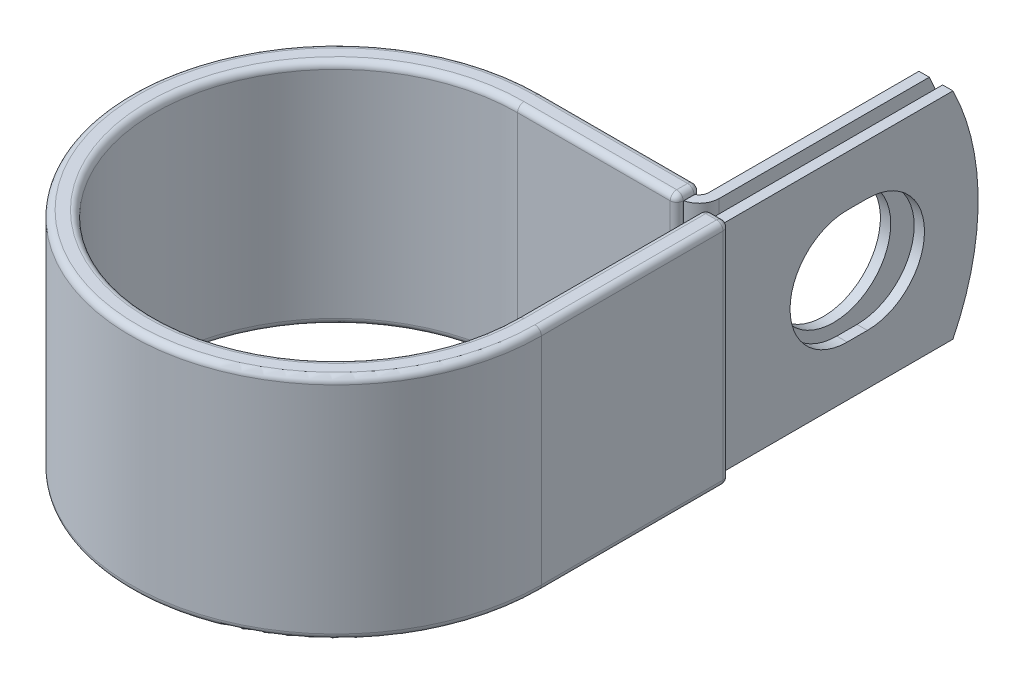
ISO-10303-21;
HEADER;
FILE_DESCRIPTION(('STEP AP214'),'2;1');
FILE_NAME('part.step','',(''),(''),'','','');
FILE_SCHEMA(('AUTOMOTIVE_DESIGN { 1 0 10303 214 1 1 1 1 }'));
ENDSEC;
DATA;
#1=APPLICATION_CONTEXT('core data for automotive mechanical design processes');
#2=APPLICATION_PROTOCOL_DEFINITION('international standard','automotive_design',2000,#1);
#3=PRODUCT_CONTEXT('',#1,'mechanical');
#4=PRODUCT('Part','Part','',(#3));
#5=PRODUCT_RELATED_PRODUCT_CATEGORY('part','',(#4));
#6=PRODUCT_DEFINITION_FORMATION('','',#4);
#7=PRODUCT_DEFINITION_CONTEXT('part definition',#1,'design');
#8=PRODUCT_DEFINITION('design','',#6,#7);
#9=PRODUCT_DEFINITION_SHAPE('','',#8);
#10=(LENGTH_UNIT() NAMED_UNIT(*) SI_UNIT(.MILLI.,.METRE.));
#11=(NAMED_UNIT(*) PLANE_ANGLE_UNIT() SI_UNIT($,.RADIAN.));
#12=(NAMED_UNIT(*) SI_UNIT($,.STERADIAN.) SOLID_ANGLE_UNIT());
#13=UNCERTAINTY_MEASURE_WITH_UNIT(LENGTH_MEASURE(1.E-05),#10,'distance_accuracy_value','');
#14=(GEOMETRIC_REPRESENTATION_CONTEXT(3) GLOBAL_UNCERTAINTY_ASSIGNED_CONTEXT((#13)) GLOBAL_UNIT_ASSIGNED_CONTEXT((#10,
#11,#12)) REPRESENTATION_CONTEXT('',''));
#15=CARTESIAN_POINT('',(0.,0.,0.));
#16=DIRECTION('',(0.,0.,1.));
#17=DIRECTION('',(1.,0.,0.));
#18=AXIS2_PLACEMENT_3D('',#15,#16,#17);
#19=CARTESIAN_POINT('',(20.64385,12.7,-52.3748));
#20=DIRECTION('',(1.,0.,0.));
#21=DIRECTION('',(0.,0.,-1.));
#22=AXIS2_PLACEMENT_3D('',#19,#20,#21);
#23=PLANE('',#22);
#24=CARTESIAN_POINT('',(20.64385,0.,-38.1));
#25=DIRECTION('',(1.,0.,0.));
#26=DIRECTION('',(0.,0.,-1.));
#27=AXIS2_PLACEMENT_3D('',#24,#25,#26);
#28=CIRCLE('',#27,6.7437);
#29=CARTESIAN_POINT('',(20.64385,0.,-44.8437));
#30=VERTEX_POINT('',#29);
#31=EDGE_CURVE('E460',#30,#30,#28,.F.);
#32=ORIENTED_EDGE('',*,*,#31,.T.);
#33=EDGE_LOOP('',(#32));
#34=FACE_BOUND('',#33,.T.);
#35=DIRECTION('',(0.,0.,1.));
#36=VECTOR('',#35,1.);
#37=CARTESIAN_POINT('',(20.64385,-12.7,-52.3748));
#38=LINE('',#37,#36);
#39=CARTESIAN_POINT('',(20.64385,-12.7,-49.3974683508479));
#40=VERTEX_POINT('',#39);
#41=CARTESIAN_POINT('',(20.64385,-12.7,-24.59609));
#42=VERTEX_POINT('',#41);
#43=EDGE_CURVE('E482',#40,#42,#38,.T.);
#44=ORIENTED_EDGE('',*,*,#43,.F.);
#45=CARTESIAN_POINT('',(20.64385,0.,-23.7998));
#46=DIRECTION('',(1.,0.,0.));
#47=DIRECTION('',(0.,0.,-1.));
#48=AXIS2_PLACEMENT_3D('',#45,#46,#47);
#49=CIRCLE('',#48,28.575);
#50=CARTESIAN_POINT('',(20.64385,12.7,-49.3974683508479));
#51=VERTEX_POINT('',#50);
#52=EDGE_CURVE('E419',#40,#51,#49,.T.);
#53=ORIENTED_EDGE('',*,*,#52,.T.);
#54=DIRECTION('',(0.,0.,1.));
#55=VECTOR('',#54,1.);
#56=CARTESIAN_POINT('',(20.64385,12.7,-52.3748));
#57=LINE('',#56,#55);
#58=CARTESIAN_POINT('',(20.64385,12.7,-24.59609));
#59=VERTEX_POINT('',#58);
#60=EDGE_CURVE('E472',#51,#59,#57,.T.);
#61=ORIENTED_EDGE('',*,*,#60,.T.);
#62=DIRECTION('',(0.,-1.,0.));
#63=VECTOR('',#62,1.);
#64=CARTESIAN_POINT('',(20.64385,12.7,-24.59609));
#65=LINE('',#64,#63);
#66=EDGE_CURVE('E489',#59,#42,#65,.T.);
#67=ORIENTED_EDGE('',*,*,#66,.T.);
#68=EDGE_LOOP('',(#44,#53,#61,#67));
#69=FACE_BOUND('',#68,.T.);
#70=ADVANCED_FACE('F54',(#34,#69),#23,.T.);
#71=CARTESIAN_POINT('',(19.42465,12.7,-52.3748));
#72=DIRECTION('',(1.,0.,0.));
#73=DIRECTION('',(0.,0.,-1.));
#74=AXIS2_PLACEMENT_3D('',#71,#72,#73);
#75=PLANE('',#74);
#76=CARTESIAN_POINT('',(19.42465,0.,-38.1));
#77=DIRECTION('',(-1.,0.,0.));
#78=DIRECTION('',(0.,0.,1.));
#79=AXIS2_PLACEMENT_3D('',#76,#77,#78);
#80=CIRCLE('',#79,6.7437);
#81=CARTESIAN_POINT('',(19.42465,0.,-31.3563));
#82=VERTEX_POINT('',#81);
#83=EDGE_CURVE('E457',#82,#82,#80,.T.);
#84=ORIENTED_EDGE('',*,*,#83,.F.);
#85=EDGE_LOOP('',(#84));
#86=FACE_BOUND('',#85,.T.);
#87=CARTESIAN_POINT('',(19.42465,0.,-23.7998));
#88=DIRECTION('',(-1.,0.,0.));
#89=DIRECTION('',(0.,0.,1.));
#90=AXIS2_PLACEMENT_3D('',#87,#88,#89);
#91=CIRCLE('',#90,28.575);
#92=CARTESIAN_POINT('',(19.42465,12.7,-49.3974683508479));
#93=VERTEX_POINT('',#92);
#94=CARTESIAN_POINT('',(19.42465,-12.7,-49.3974683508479));
#95=VERTEX_POINT('',#94);
#96=EDGE_CURVE('E411',#93,#95,#91,.T.);
#97=ORIENTED_EDGE('',*,*,#96,.T.);
#98=DIRECTION('',(0.,0.,-1.));
#99=VECTOR('',#98,1.);
#100=CARTESIAN_POINT('',(19.42465,-12.7,-52.3748));
#101=LINE('',#100,#99);
#102=CARTESIAN_POINT('',(19.42465,-12.7,-24.59609));
#103=VERTEX_POINT('',#102);
#104=EDGE_CURVE('E484',#95,#103,#101,.F.);
#105=ORIENTED_EDGE('',*,*,#104,.T.);
#106=DIRECTION('',(0.,-1.,0.));
#107=VECTOR('',#106,1.);
#108=CARTESIAN_POINT('',(19.42465,12.7,-24.59609));
#109=LINE('',#108,#107);
#110=CARTESIAN_POINT('',(19.42465,12.7,-24.59609));
#111=VERTEX_POINT('',#110);
#112=EDGE_CURVE('E477',#111,#103,#109,.T.);
#113=ORIENTED_EDGE('',*,*,#112,.F.);
#114=DIRECTION('',(0.,0.,-1.));
#115=VECTOR('',#114,1.);
#116=CARTESIAN_POINT('',(19.42465,12.7,-52.3748));
#117=LINE('',#116,#115);
#118=EDGE_CURVE('E474',#93,#111,#117,.F.);
#119=ORIENTED_EDGE('',*,*,#118,.F.);
#120=EDGE_LOOP('',(#97,#105,#113,#119));
#121=FACE_BOUND('',#120,.T.);
#122=ADVANCED_FACE('F788',(#86,#121),#75,.F.);
#123=CARTESIAN_POINT('',(0.,-12.7,0.));
#124=DIRECTION('',(0.,1.,0.));
#125=DIRECTION('',(1.,0.,0.));
#126=AXIS2_PLACEMENT_3D('',#123,#124,#125);
#127=PLANE('',#126);
#128=CARTESIAN_POINT('',(18.26641,-12.7,-24.59609));
#129=DIRECTION('',(0.,-1.,0.));
#130=DIRECTION('',(0.,0.,1.));
#131=AXIS2_PLACEMENT_3D('',#128,#129,#130);
#132=CIRCLE('',#131,2.37744);
#133=CARTESIAN_POINT('',(18.7896500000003,-12.7,-22.2769434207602));
#134=VERTEX_POINT('',#133);
#135=EDGE_CURVE('E479',#42,#134,#132,.T.);
#136=ORIENTED_EDGE('',*,*,#135,.T.);
#137=DIRECTION('',(0.,0.,-1.));
#138=VECTOR('',#137,1.);
#139=CARTESIAN_POINT('',(18.7896500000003,-12.7,-23.43785));
#140=LINE('',#139,#138);
#141=CARTESIAN_POINT('',(18.7896500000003,-12.7,-23.4696));
#142=VERTEX_POINT('',#141);
#143=EDGE_CURVE('E368',#134,#142,#140,.T.);
#144=ORIENTED_EDGE('',*,*,#143,.T.);
#145=CARTESIAN_POINT('',(18.0276500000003,-12.7,-23.4696));
#146=DIRECTION('',(0.,1.,0.));
#147=DIRECTION('',(0.,0.,1.));
#148=AXIS2_PLACEMENT_3D('',#145,#146,#147);
#149=CIRCLE('',#148,0.762);
#150=CARTESIAN_POINT('',(18.7842610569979,-12.7,-23.5600638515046));
#151=VERTEX_POINT('',#150);
#152=EDGE_CURVE('E554',#142,#151,#149,.T.);
#153=ORIENTED_EDGE('',*,*,#152,.T.);
#154=CARTESIAN_POINT('',(18.26641,-12.7,-24.59609));
#155=DIRECTION('',(0.,1.,0.));
#156=DIRECTION('',(1.,0.,0.));
#157=AXIS2_PLACEMENT_3D('',#154,#155,#156);
#158=CIRCLE('',#157,1.15824);
#159=EDGE_CURVE('E77',#103,#151,#158,.F.);
#160=ORIENTED_EDGE('',*,*,#159,.F.);
#161=ORIENTED_EDGE('',*,*,#104,.F.);
#162=DIRECTION('',(-1.,0.,0.));
#163=VECTOR('',#162,1.);
#164=CARTESIAN_POINT('',(23.43785,-12.7,-49.3974683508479));
#165=LINE('',#164,#163);
#166=EDGE_CURVE('E498',#40,#95,#165,.T.);
#167=ORIENTED_EDGE('',*,*,#166,.F.);
#168=ORIENTED_EDGE('',*,*,#43,.T.);
#169=EDGE_LOOP('',(#136,#144,#153,#160,#161,#167,#168));
#170=FACE_BOUND('',#169,.T.);
#171=ADVANCED_FACE('F794',(#170),#127,.F.);
#172=CARTESIAN_POINT('',(0.,12.7,0.));
#173=DIRECTION('',(0.,1.,0.));
#174=DIRECTION('',(1.,0.,0.));
#175=AXIS2_PLACEMENT_3D('',#172,#173,#174);
#176=PLANE('',#175);
#177=DIRECTION('',(0.,0.,-1.));
#178=VECTOR('',#177,1.);
#179=CARTESIAN_POINT('',(18.78965,12.7,2.63565383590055E-13));
#180=LINE('',#179,#178);
#181=CARTESIAN_POINT('',(18.7896500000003,12.7,-22.2769434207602));
#182=VERTEX_POINT('',#181);
#183=CARTESIAN_POINT('',(18.7896500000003,12.7,-23.4696));
#184=VERTEX_POINT('',#183);
#185=EDGE_CURVE('E405',#182,#184,#180,.T.);
#186=ORIENTED_EDGE('',*,*,#185,.F.);
#187=CARTESIAN_POINT('',(18.26641,12.7,-24.59609));
#188=DIRECTION('',(0.,-1.,0.));
#189=DIRECTION('',(0.,0.,1.));
#190=AXIS2_PLACEMENT_3D('',#187,#188,#189);
#191=CIRCLE('',#190,2.37744);
#192=EDGE_CURVE('E469',#59,#182,#191,.T.);
#193=ORIENTED_EDGE('',*,*,#192,.F.);
#194=ORIENTED_EDGE('',*,*,#60,.F.);
#195=DIRECTION('',(-1.,0.,0.));
#196=VECTOR('',#195,1.);
#197=CARTESIAN_POINT('',(23.43785,12.7,-49.3974683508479));
#198=LINE('',#197,#196);
#199=EDGE_CURVE('E495',#51,#93,#198,.T.);
#200=ORIENTED_EDGE('',*,*,#199,.T.);
#201=ORIENTED_EDGE('',*,*,#118,.T.);
#202=CARTESIAN_POINT('',(18.26641,12.7,-24.59609));
#203=DIRECTION('',(0.,1.,0.));
#204=DIRECTION('',(1.,0.,0.));
#205=AXIS2_PLACEMENT_3D('',#202,#203,#204);
#206=CIRCLE('',#205,1.15824);
#207=CARTESIAN_POINT('',(18.7842610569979,12.7,-23.5600638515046));
#208=VERTEX_POINT('',#207);
#209=EDGE_CURVE('E70',#111,#208,#206,.F.);
#210=ORIENTED_EDGE('',*,*,#209,.T.);
#211=CARTESIAN_POINT('',(18.0276500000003,12.7,-23.4696));
#212=DIRECTION('',(0.,1.,0.));
#213=DIRECTION('',(0.,0.,1.));
#214=AXIS2_PLACEMENT_3D('',#211,#212,#213);
#215=CIRCLE('',#214,0.762);
#216=EDGE_CURVE('E12',#208,#184,#215,.F.);
#217=ORIENTED_EDGE('',*,*,#216,.T.);
#218=EDGE_LOOP('',(#186,#193,#194,#200,#201,#210,#217));
#219=FACE_BOUND('',#218,.T.);
#220=ADVANCED_FACE('F802',(#219),#176,.T.);
#221=CARTESIAN_POINT('',(18.26641,12.7,-24.59609));
#222=DIRECTION('',(0.,-1.,0.));
#223=DIRECTION('',(0.,0.,-1.));
#224=AXIS2_PLACEMENT_3D('',#221,#222,#223);
#225=CYLINDRICAL_SURFACE('',#224,2.37744);
#226=ORIENTED_EDGE('',*,*,#135,.F.);
#227=ORIENTED_EDGE('',*,*,#66,.F.);
#228=ORIENTED_EDGE('',*,*,#192,.T.);
#229=CARTESIAN_POINT('',(18.26641,12.7,-24.59609));
#230=DIRECTION('',(0.,-1.,0.));
#231=DIRECTION('',(0.,0.,-1.));
#232=AXIS2_PLACEMENT_3D('',#229,#230,#231);
#233=CIRCLE('',#232,2.37744);
#234=CARTESIAN_POINT('',(18.26641,12.7,-22.21865));
#235=VERTEX_POINT('',#234);
#236=EDGE_CURVE('E402',#235,#182,#233,.F.);
#237=ORIENTED_EDGE('',*,*,#236,.F.);
#238=DIRECTION('',(0.,-1.,0.));
#239=VECTOR('',#238,1.);
#240=CARTESIAN_POINT('',(18.26641,12.7,-22.21865));
#241=LINE('',#240,#239);
#242=CARTESIAN_POINT('',(18.26641,-12.7,-22.21865));
#243=VERTEX_POINT('',#242);
#244=EDGE_CURVE('E492',#235,#243,#241,.T.);
#245=ORIENTED_EDGE('',*,*,#244,.T.);
#246=CARTESIAN_POINT('',(18.26641,-12.7,-24.59609));
#247=DIRECTION('',(0.,1.,0.));
#248=DIRECTION('',(0.,0.,1.));
#249=AXIS2_PLACEMENT_3D('',#246,#247,#248);
#250=CIRCLE('',#249,2.37744);
#251=EDGE_CURVE('E400',#134,#243,#250,.F.);
#252=ORIENTED_EDGE('',*,*,#251,.F.);
#253=EDGE_LOOP('',(#226,#227,#228,#237,#245,#252));
#254=FACE_BOUND('',#253,.T.);
#255=ADVANCED_FACE('F799',(#254),#225,.T.);
#256=CARTESIAN_POINT('',(18.26641,12.7,-24.59609));
#257=DIRECTION('',(0.,-1.,0.));
#258=DIRECTION('',(0.,0.,-1.));
#259=AXIS2_PLACEMENT_3D('',#256,#257,#258);
#260=CYLINDRICAL_SURFACE('',#259,1.15824);
#261=ORIENTED_EDGE('',*,*,#159,.T.);
#262=DIRECTION('',(0.,1.,0.));
#263=VECTOR('',#262,1.);
#264=CARTESIAN_POINT('',(18.7842610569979,-12.7,-23.5600638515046));
#265=LINE('',#264,#263);
#266=EDGE_CURVE('E63',#151,#208,#265,.T.);
#267=ORIENTED_EDGE('',*,*,#266,.T.);
#268=ORIENTED_EDGE('',*,*,#209,.F.);
#269=ORIENTED_EDGE('',*,*,#112,.T.);
#270=EDGE_LOOP('',(#261,#267,#268,#269));
#271=FACE_BOUND('',#270,.T.);
#272=ADVANCED_FACE('F801',(#271),#260,.F.);
#273=CARTESIAN_POINT('',(39.7179140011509,0.,-38.1));
#274=DIRECTION('',(-1.,0.,0.));
#275=DIRECTION('',(0.,0.,1.));
#276=AXIS2_PLACEMENT_3D('',#273,#274,#275);
#277=CYLINDRICAL_SURFACE('',#276,6.7437);
#278=ORIENTED_EDGE('',*,*,#83,.T.);
#279=EDGE_LOOP('',(#278));
#280=FACE_BOUND('',#279,.T.);
#281=ORIENTED_EDGE('',*,*,#31,.F.);
#282=EDGE_LOOP('',(#281));
#283=FACE_BOUND('',#282,.T.);
#284=ADVANCED_FACE('F808',(#280,#283),#277,.F.);
#285=CARTESIAN_POINT('',(23.43785,0.,-23.7998));
#286=DIRECTION('',(-1.,0.,0.));
#287=DIRECTION('',(0.,0.,1.));
#288=AXIS2_PLACEMENT_3D('',#285,#286,#287);
#289=CYLINDRICAL_SURFACE('',#288,28.575);
#290=ORIENTED_EDGE('',*,*,#52,.F.);
#291=ORIENTED_EDGE('',*,*,#166,.T.);
#292=ORIENTED_EDGE('',*,*,#96,.F.);
#293=ORIENTED_EDGE('',*,*,#199,.F.);
#294=EDGE_LOOP('',(#290,#291,#292,#293));
#295=FACE_BOUND('',#294,.T.);
#296=ADVANCED_FACE('F859',(#295),#289,.T.);
#297=CARTESIAN_POINT('',(3.11664507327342E-13,-12.7,-22.21865));
#298=DIRECTION('',(0.,0.,1.));
#299=DIRECTION('',(1.,0.,0.));
#300=AXIS2_PLACEMENT_3D('',#297,#298,#299);
#301=PLANE('',#300);
#302=DIRECTION('',(1.,0.,0.));
#303=VECTOR('',#302,1.);
#304=CARTESIAN_POINT('',(3.11664507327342E-13,-12.7,-22.21865));
#305=LINE('',#304,#303);
#306=CARTESIAN_POINT('',(18.7896500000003,-12.7,-22.21865));
#307=VERTEX_POINT('',#306);
#308=EDGE_CURVE('E375',#243,#307,#305,.T.);
#309=ORIENTED_EDGE('',*,*,#308,.F.);
#310=ORIENTED_EDGE('',*,*,#244,.F.);
#311=DIRECTION('',(1.,0.,0.));
#312=VECTOR('',#311,1.);
#313=CARTESIAN_POINT('',(3.11664507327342E-13,12.7,-22.21865));
#314=LINE('',#313,#312);
#315=CARTESIAN_POINT('',(18.7896500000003,12.7,-22.21865));
#316=VERTEX_POINT('',#315);
#317=EDGE_CURVE('E377',#235,#316,#314,.T.);
#318=ORIENTED_EDGE('',*,*,#317,.T.);
#319=DIRECTION('',(0.,-1.,0.));
#320=VECTOR('',#319,1.);
#321=CARTESIAN_POINT('',(18.7896500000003,-12.7,-22.21865));
#322=LINE('',#321,#320);
#323=EDGE_CURVE('E307',#316,#307,#322,.T.);
#324=ORIENTED_EDGE('',*,*,#323,.T.);
#325=EDGE_LOOP('',(#309,#310,#318,#324));
#326=FACE_BOUND('',#325,.T.);
#327=ADVANCED_FACE('F831',(#326),#301,.F.);
#328=CARTESIAN_POINT('',(18.7896500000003,-12.73175,-22.1869));
#329=DIRECTION('',(1.,0.,0.));
#330=DIRECTION('',(0.,0.,-1.));
#331=AXIS2_PLACEMENT_3D('',#328,#329,#330);
#332=PLANE('',#331);
#333=DIRECTION('',(0.,0.,-1.));
#334=VECTOR('',#333,1.);
#335=CARTESIAN_POINT('',(18.7896500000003,-12.73175,-23.4696));
#336=LINE('',#335,#334);
#337=CARTESIAN_POINT('',(18.7896500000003,-12.73175,-22.1869));
#338=VERTEX_POINT('',#337);
#339=CARTESIAN_POINT('',(18.7896500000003,-12.73175,-23.4696));
#340=VERTEX_POINT('',#339);
#341=EDGE_CURVE('E508',#338,#340,#336,.T.);
#342=ORIENTED_EDGE('',*,*,#341,.T.);
#343=DIRECTION('',(0.,1.,0.));
#344=VECTOR('',#343,1.);
#345=CARTESIAN_POINT('',(18.7896500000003,-12.73175,-23.4696));
#346=LINE('',#345,#344);
#347=EDGE_CURVE('E512',#340,#142,#346,.T.);
#348=ORIENTED_EDGE('',*,*,#347,.T.);
#349=ORIENTED_EDGE('',*,*,#143,.F.);
#350=EDGE_CURVE('E369',#307,#134,#140,.T.);
#351=ORIENTED_EDGE('',*,*,#350,.F.);
#352=ORIENTED_EDGE('',*,*,#323,.F.);
#353=DIRECTION('',(0.,0.,1.));
#354=VECTOR('',#353,1.);
#355=CARTESIAN_POINT('',(18.7896500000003,12.7,-22.21865));
#356=LINE('',#355,#354);
#357=EDGE_CURVE('E372',#182,#316,#356,.T.);
#358=ORIENTED_EDGE('',*,*,#357,.F.);
#359=ORIENTED_EDGE('',*,*,#185,.T.);
#360=DIRECTION('',(0.,1.,0.));
#361=VECTOR('',#360,1.);
#362=CARTESIAN_POINT('',(18.7896500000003,-12.73175,-23.4696));
#363=LINE('',#362,#361);
#364=CARTESIAN_POINT('',(18.7896500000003,12.73175,-23.4696));
#365=VERTEX_POINT('',#364);
#366=EDGE_CURVE('E510',#184,#365,#363,.T.);
#367=ORIENTED_EDGE('',*,*,#366,.T.);
#368=DIRECTION('',(0.,0.,1.));
#369=VECTOR('',#368,1.);
#370=CARTESIAN_POINT('',(18.7896500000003,12.73175,-22.1869));
#371=LINE('',#370,#369);
#372=CARTESIAN_POINT('',(18.7896500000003,12.73175,-22.1869));
#373=VERTEX_POINT('',#372);
#374=EDGE_CURVE('E504',#365,#373,#371,.T.);
#375=ORIENTED_EDGE('',*,*,#374,.T.);
#376=DIRECTION('',(0.,-1.,0.));
#377=VECTOR('',#376,1.);
#378=CARTESIAN_POINT('',(18.7896500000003,-12.73175,-22.1869));
#379=LINE('',#378,#377);
#380=EDGE_CURVE('E506',#373,#338,#379,.T.);
#381=ORIENTED_EDGE('',*,*,#380,.T.);
#382=EDGE_LOOP('',(#342,#348,#349,#351,#352,#358,#359,#367,#375,#381));
#383=FACE_BOUND('',#382,.T.);
#384=ADVANCED_FACE('F827',(#383),#332,.T.);
#385=CARTESIAN_POINT('',(3.29211780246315E-13,-12.73175,-23.4696));
#386=DIRECTION('',(1.,0.,0.));
#387=DIRECTION('',(0.,0.,-1.));
#388=AXIS2_PLACEMENT_3D('',#385,#386,#387);
#389=CYLINDRICAL_SURFACE('',#388,0.762);
#390=DIRECTION('',(1.,0.,0.));
#391=VECTOR('',#390,1.);
#392=CARTESIAN_POINT('',(3.39900474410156E-13,-12.73175,-24.2316));
#393=LINE('',#392,#391);
#394=CARTESIAN_POINT('',(3.39900474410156E-13,-12.73175,-24.2316));
#395=VERTEX_POINT('',#394);
#396=CARTESIAN_POINT('',(18.0276500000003,-12.73175,-24.2316));
#397=VERTEX_POINT('',#396);
#398=EDGE_CURVE('E394',#395,#397,#393,.T.);
#399=ORIENTED_EDGE('',*,*,#398,.T.);
#400=CARTESIAN_POINT('',(18.0276500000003,-12.73175,-23.4696));
#401=DIRECTION('',(1.,0.,0.));
#402=DIRECTION('',(0.,0.,-1.));
#403=AXIS2_PLACEMENT_3D('',#400,#401,#402);
#404=CIRCLE('',#403,0.762);
#405=CARTESIAN_POINT('',(18.0276500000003,-13.49375,-23.4696));
#406=VERTEX_POINT('',#405);
#407=EDGE_CURVE('E517',#397,#406,#404,.F.);
#408=ORIENTED_EDGE('',*,*,#407,.T.);
#409=DIRECTION('',(1.,0.,0.));
#410=VECTOR('',#409,1.);
#411=CARTESIAN_POINT('',(3.29211780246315E-13,-13.49375,-23.4696));
#412=LINE('',#411,#410);
#413=CARTESIAN_POINT('',(3.29211780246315E-13,-13.49375,-23.4696));
#414=VERTEX_POINT('',#413);
#415=EDGE_CURVE('E397',#414,#406,#412,.T.);
#416=ORIENTED_EDGE('',*,*,#415,.F.);
#417=CARTESIAN_POINT('',(3.29211780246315E-13,-12.73175,-23.4696));
#418=DIRECTION('',(1.,0.,0.));
#419=DIRECTION('',(0.,0.,1.));
#420=AXIS2_PLACEMENT_3D('',#417,#418,#419);
#421=CIRCLE('',#420,0.762);
#422=EDGE_CURVE('E345',#414,#395,#421,.T.);
#423=ORIENTED_EDGE('',*,*,#422,.T.);
#424=EDGE_LOOP('',(#399,#408,#416,#423));
#425=FACE_BOUND('',#424,.T.);
#426=ADVANCED_FACE('F670',(#425),#389,.T.);
#427=CARTESIAN_POINT('',(3.39900474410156E-13,12.73175,-24.2316));
#428=DIRECTION('',(0.,0.,-1.));
#429=DIRECTION('',(0.,1.,0.));
#430=AXIS2_PLACEMENT_3D('',#427,#428,#429);
#431=PLANE('',#430);
#432=DIRECTION('',(1.,0.,0.));
#433=VECTOR('',#432,1.);
#434=CARTESIAN_POINT('',(3.39900474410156E-13,12.73175,-24.2316));
#435=LINE('',#434,#433);
#436=CARTESIAN_POINT('',(3.39900474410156E-13,12.73175,-24.2316));
#437=VERTEX_POINT('',#436);
#438=CARTESIAN_POINT('',(18.0276500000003,12.73175,-24.2316));
#439=VERTEX_POINT('',#438);
#440=EDGE_CURVE('E391',#437,#439,#435,.T.);
#441=ORIENTED_EDGE('',*,*,#440,.T.);
#442=DIRECTION('',(0.,1.,0.));
#443=VECTOR('',#442,1.);
#444=CARTESIAN_POINT('',(18.0276500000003,12.73175,-24.2316));
#445=LINE('',#444,#443);
#446=EDGE_CURVE('E515',#439,#397,#445,.F.);
#447=ORIENTED_EDGE('',*,*,#446,.T.);
#448=ORIENTED_EDGE('',*,*,#398,.F.);
#449=DIRECTION('',(0.,1.,0.));
#450=VECTOR('',#449,1.);
#451=CARTESIAN_POINT('',(3.39900474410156E-13,12.73175,-24.2316));
#452=LINE('',#451,#450);
#453=EDGE_CURVE('E342',#395,#437,#452,.T.);
#454=ORIENTED_EDGE('',*,*,#453,.T.);
#455=EDGE_LOOP('',(#441,#447,#448,#454));
#456=FACE_BOUND('',#455,.T.);
#457=ADVANCED_FACE('F676',(#456),#431,.T.);
#458=CARTESIAN_POINT('',(3.29211780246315E-13,12.73175,-23.4696));
#459=DIRECTION('',(1.,0.,0.));
#460=DIRECTION('',(0.,0.,-1.));
#461=AXIS2_PLACEMENT_3D('',#458,#459,#460);
#462=CYLINDRICAL_SURFACE('',#461,0.761999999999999);
#463=DIRECTION('',(1.,0.,0.));
#464=VECTOR('',#463,1.);
#465=CARTESIAN_POINT('',(3.29211780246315E-13,13.49375,-23.4696));
#466=LINE('',#465,#464);
#467=CARTESIAN_POINT('',(3.29211780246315E-13,13.49375,-23.4696));
#468=VERTEX_POINT('',#467);
#469=CARTESIAN_POINT('',(18.0276500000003,13.49375,-23.4696));
#470=VERTEX_POINT('',#469);
#471=EDGE_CURVE('E388',#468,#470,#466,.T.);
#472=ORIENTED_EDGE('',*,*,#471,.T.);
#473=CARTESIAN_POINT('',(18.0276500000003,12.73175,-23.4696));
#474=DIRECTION('',(1.,0.,0.));
#475=DIRECTION('',(0.,0.,-1.));
#476=AXIS2_PLACEMENT_3D('',#473,#474,#475);
#477=CIRCLE('',#476,0.761999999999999);
#478=EDGE_CURVE('E501',#470,#439,#477,.F.);
#479=ORIENTED_EDGE('',*,*,#478,.T.);
#480=ORIENTED_EDGE('',*,*,#440,.F.);
#481=CARTESIAN_POINT('',(3.29211780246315E-13,12.73175,-23.4696));
#482=DIRECTION('',(1.,0.,0.));
#483=DIRECTION('',(0.,0.,1.));
#484=AXIS2_PLACEMENT_3D('',#481,#482,#483);
#485=CIRCLE('',#484,0.761999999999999);
#486=EDGE_CURVE('E339',#437,#468,#485,.T.);
#487=ORIENTED_EDGE('',*,*,#486,.T.);
#488=EDGE_LOOP('',(#472,#479,#480,#487));
#489=FACE_BOUND('',#488,.T.);
#490=ADVANCED_FACE('F680',(#489),#462,.T.);
#491=CARTESIAN_POINT('',(3.11219145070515E-13,12.73175,-22.1869));
#492=DIRECTION('',(1.,0.,0.));
#493=DIRECTION('',(0.,0.,-1.));
#494=AXIS2_PLACEMENT_3D('',#491,#492,#493);
#495=CYLINDRICAL_SURFACE('',#494,0.762);
#496=DIRECTION('',(1.,0.,0.));
#497=VECTOR('',#496,1.);
#498=CARTESIAN_POINT('',(3.00530450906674E-13,12.73175,-21.4249));
#499=LINE('',#498,#497);
#500=CARTESIAN_POINT('',(3.00530450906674E-13,12.73175,-21.4249));
#501=VERTEX_POINT('',#500);
#502=CARTESIAN_POINT('',(18.0276500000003,12.73175,-21.4249));
#503=VERTEX_POINT('',#502);
#504=EDGE_CURVE('E382',#501,#503,#499,.T.);
#505=ORIENTED_EDGE('',*,*,#504,.T.);
#506=CARTESIAN_POINT('',(18.0276500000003,12.73175,-22.1869));
#507=DIRECTION('',(1.,0.,0.));
#508=DIRECTION('',(0.,0.,-1.));
#509=AXIS2_PLACEMENT_3D('',#506,#507,#508);
#510=CIRCLE('',#509,0.762);
#511=CARTESIAN_POINT('',(18.0276500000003,13.49375,-22.1869));
#512=VERTEX_POINT('',#511);
#513=EDGE_CURVE('E527',#503,#512,#510,.F.);
#514=ORIENTED_EDGE('',*,*,#513,.T.);
#515=DIRECTION('',(1.,0.,0.));
#516=VECTOR('',#515,1.);
#517=CARTESIAN_POINT('',(3.11219145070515E-13,13.49375,-22.1869));
#518=LINE('',#517,#516);
#519=CARTESIAN_POINT('',(3.11219145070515E-13,13.49375,-22.1869));
#520=VERTEX_POINT('',#519);
#521=EDGE_CURVE('E385',#520,#512,#518,.T.);
#522=ORIENTED_EDGE('',*,*,#521,.F.);
#523=CARTESIAN_POINT('',(3.11219145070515E-13,12.73175,-22.1869));
#524=DIRECTION('',(1.,0.,0.));
#525=DIRECTION('',(0.,0.,1.));
#526=AXIS2_PLACEMENT_3D('',#523,#524,#525);
#527=CIRCLE('',#526,0.762);
#528=EDGE_CURVE('E336',#520,#501,#527,.T.);
#529=ORIENTED_EDGE('',*,*,#528,.T.);
#530=EDGE_LOOP('',(#505,#514,#522,#529));
#531=FACE_BOUND('',#530,.T.);
#532=ADVANCED_FACE('F721',(#531),#495,.T.);
#533=CARTESIAN_POINT('',(3.00530450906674E-13,-12.73175,-21.4249));
#534=DIRECTION('',(0.,0.,1.));
#535=DIRECTION('',(1.,0.,0.));
#536=AXIS2_PLACEMENT_3D('',#533,#534,#535);
#537=PLANE('',#536);
#538=DIRECTION('',(1.,0.,0.));
#539=VECTOR('',#538,1.);
#540=CARTESIAN_POINT('',(3.00530450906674E-13,-12.73175,-21.4249));
#541=LINE('',#540,#539);
#542=CARTESIAN_POINT('',(3.00530450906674E-13,-12.73175,-21.4249));
#543=VERTEX_POINT('',#542);
#544=CARTESIAN_POINT('',(18.0276500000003,-12.73175,-21.4249));
#545=VERTEX_POINT('',#544);
#546=EDGE_CURVE('E379',#543,#545,#541,.T.);
#547=ORIENTED_EDGE('',*,*,#546,.T.);
#548=DIRECTION('',(0.,-1.,0.));
#549=VECTOR('',#548,1.);
#550=CARTESIAN_POINT('',(18.0276500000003,-12.73175,-21.4249));
#551=LINE('',#550,#549);
#552=EDGE_CURVE('E525',#545,#503,#551,.F.);
#553=ORIENTED_EDGE('',*,*,#552,.T.);
#554=ORIENTED_EDGE('',*,*,#504,.F.);
#555=DIRECTION('',(0.,-1.,0.));
#556=VECTOR('',#555,1.);
#557=CARTESIAN_POINT('',(3.00530450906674E-13,-12.73175,-21.4249));
#558=LINE('',#557,#556);
#559=EDGE_CURVE('E327',#501,#543,#558,.T.);
#560=ORIENTED_EDGE('',*,*,#559,.T.);
#561=EDGE_LOOP('',(#547,#553,#554,#560));
#562=FACE_BOUND('',#561,.T.);
#563=ADVANCED_FACE('F719',(#562),#537,.T.);
#564=CARTESIAN_POINT('',(3.11219145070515E-13,-12.73175,-22.1869));
#565=DIRECTION('',(1.,0.,0.));
#566=DIRECTION('',(0.,0.,-1.));
#567=AXIS2_PLACEMENT_3D('',#564,#565,#566);
#568=CYLINDRICAL_SURFACE('',#567,0.762);
#569=DIRECTION('',(1.,0.,0.));
#570=VECTOR('',#569,1.);
#571=CARTESIAN_POINT('',(3.11219145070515E-13,-13.49375,-22.1869));
#572=LINE('',#571,#570);
#573=CARTESIAN_POINT('',(3.11219145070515E-13,-13.49375,-22.1869));
#574=VERTEX_POINT('',#573);
#575=CARTESIAN_POINT('',(18.0276500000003,-13.49375,-22.1869));
#576=VERTEX_POINT('',#575);
#577=EDGE_CURVE('E303',#574,#576,#572,.T.);
#578=ORIENTED_EDGE('',*,*,#577,.T.);
#579=CARTESIAN_POINT('',(18.0276500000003,-12.73175,-22.1869));
#580=DIRECTION('',(1.,0.,0.));
#581=DIRECTION('',(0.,0.,-1.));
#582=AXIS2_PLACEMENT_3D('',#579,#580,#581);
#583=CIRCLE('',#582,0.762);
#584=EDGE_CURVE('E523',#576,#545,#583,.F.);
#585=ORIENTED_EDGE('',*,*,#584,.T.);
#586=ORIENTED_EDGE('',*,*,#546,.F.);
#587=CARTESIAN_POINT('',(3.11219145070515E-13,-12.73175,-22.1869));
#588=DIRECTION('',(1.,0.,0.));
#589=DIRECTION('',(0.,0.,-1.));
#590=AXIS2_PLACEMENT_3D('',#587,#588,#589);
#591=CIRCLE('',#590,0.762);
#592=EDGE_CURVE('E324',#543,#574,#591,.T.);
#593=ORIENTED_EDGE('',*,*,#592,.T.);
#594=EDGE_LOOP('',(#578,#585,#586,#593));
#595=FACE_BOUND('',#594,.T.);
#596=ADVANCED_FACE('F709',(#595),#568,.T.);
#597=CARTESIAN_POINT('',(0.,-12.73175,0.));
#598=DIRECTION('',(0.,-1.,0.));
#599=DIRECTION('',(0.,0.,-1.));
#600=AXIS2_PLACEMENT_3D('',#597,#598,#599);
#601=TOROIDAL_SURFACE('',#600,23.4696,0.762);
#602=CARTESIAN_POINT('',(23.4696,-12.73175,0.));
#603=DIRECTION('',(0.,0.,1.));
#604=DIRECTION('',(-1.,0.,0.));
#605=AXIS2_PLACEMENT_3D('',#602,#603,#604);
#606=CIRCLE('',#605,0.762);
#607=CARTESIAN_POINT('',(23.4696,-13.49375,0.));
#608=VERTEX_POINT('',#607);
#609=CARTESIAN_POINT('',(24.2316,-12.73175,0.));
#610=VERTEX_POINT('',#609);
#611=EDGE_CURVE('E318',#608,#610,#606,.T.);
#612=ORIENTED_EDGE('',*,*,#611,.T.);
#613=CARTESIAN_POINT('',(0.,-12.73175,0.));
#614=DIRECTION('',(0.,-1.,0.));
#615=DIRECTION('',(0.,0.,-1.));
#616=AXIS2_PLACEMENT_3D('',#613,#614,#615);
#617=CIRCLE('',#616,24.2316);
#618=EDGE_CURVE('E361',#610,#395,#617,.T.);
#619=ORIENTED_EDGE('',*,*,#618,.T.);
#620=ORIENTED_EDGE('',*,*,#422,.F.);
#621=CARTESIAN_POINT('',(0.,-13.49375,0.));
#622=DIRECTION('',(0.,-1.,0.));
#623=DIRECTION('',(0.,0.,-1.));
#624=AXIS2_PLACEMENT_3D('',#621,#622,#623);
#625=CIRCLE('',#624,23.4696);
#626=EDGE_CURVE('E308',#608,#414,#625,.T.);
#627=ORIENTED_EDGE('',*,*,#626,.F.);
#628=EDGE_LOOP('',(#612,#619,#620,#627));
#629=FACE_BOUND('',#628,.T.);
#630=ADVANCED_FACE('F667',(#629),#601,.T.);
#631=CARTESIAN_POINT('',(0.,12.7,0.));
#632=DIRECTION('',(0.,-1.,0.));
#633=DIRECTION('',(0.,0.,-1.));
#634=AXIS2_PLACEMENT_3D('',#631,#632,#633);
#635=CYLINDRICAL_SURFACE('',#634,24.2316);
#636=DIRECTION('',(0.,1.,0.));
#637=VECTOR('',#636,1.);
#638=CARTESIAN_POINT('',(24.2316,12.73175,0.));
#639=LINE('',#638,#637);
#640=CARTESIAN_POINT('',(24.2316,12.73175,0.));
#641=VERTEX_POINT('',#640);
#642=EDGE_CURVE('E655',#610,#641,#639,.T.);
#643=ORIENTED_EDGE('',*,*,#642,.T.);
#644=CARTESIAN_POINT('',(0.,12.73175,0.));
#645=DIRECTION('',(0.,-1.,0.));
#646=DIRECTION('',(0.,0.,-1.));
#647=AXIS2_PLACEMENT_3D('',#644,#645,#646);
#648=CIRCLE('',#647,24.2316);
#649=EDGE_CURVE('E358',#641,#437,#648,.T.);
#650=ORIENTED_EDGE('',*,*,#649,.T.);
#651=ORIENTED_EDGE('',*,*,#453,.F.);
#652=ORIENTED_EDGE('',*,*,#618,.F.);
#653=EDGE_LOOP('',(#643,#650,#651,#652));
#654=FACE_BOUND('',#653,.T.);
#655=ADVANCED_FACE('F673',(#654),#635,.T.);
#656=CARTESIAN_POINT('',(0.,12.73175,0.));
#657=DIRECTION('',(0.,-1.,0.));
#658=DIRECTION('',(0.,0.,-1.));
#659=AXIS2_PLACEMENT_3D('',#656,#657,#658);
#660=TOROIDAL_SURFACE('',#659,23.4696,0.761999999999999);
#661=CARTESIAN_POINT('',(23.4696,12.73175,0.));
#662=DIRECTION('',(0.,0.,1.));
#663=DIRECTION('',(-1.,0.,0.));
#664=AXIS2_PLACEMENT_3D('',#661,#662,#663);
#665=CIRCLE('',#664,0.761999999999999);
#666=CARTESIAN_POINT('',(23.4696,13.49375,0.));
#667=VERTEX_POINT('',#666);
#668=EDGE_CURVE('E734',#641,#667,#665,.T.);
#669=ORIENTED_EDGE('',*,*,#668,.T.);
#670=CARTESIAN_POINT('',(0.,13.49375,0.));
#671=DIRECTION('',(0.,-1.,0.));
#672=DIRECTION('',(0.,0.,-1.));
#673=AXIS2_PLACEMENT_3D('',#670,#671,#672);
#674=CIRCLE('',#673,23.4696);
#675=EDGE_CURVE('E355',#667,#468,#674,.T.);
#676=ORIENTED_EDGE('',*,*,#675,.T.);
#677=ORIENTED_EDGE('',*,*,#486,.F.);
#678=ORIENTED_EDGE('',*,*,#649,.F.);
#679=EDGE_LOOP('',(#669,#676,#677,#678));
#680=FACE_BOUND('',#679,.T.);
#681=ADVANCED_FACE('F678',(#680),#660,.T.);
#682=CARTESIAN_POINT('',(0.,12.73175,0.));
#683=DIRECTION('',(0.,-1.,0.));
#684=DIRECTION('',(0.,0.,-1.));
#685=AXIS2_PLACEMENT_3D('',#682,#683,#684);
#686=TOROIDAL_SURFACE('',#685,22.1869,0.762);
#687=CARTESIAN_POINT('',(22.1869,12.73175,0.));
#688=DIRECTION('',(0.,0.,1.));
#689=DIRECTION('',(-1.,0.,0.));
#690=AXIS2_PLACEMENT_3D('',#687,#688,#689);
#691=CIRCLE('',#690,0.762);
#692=CARTESIAN_POINT('',(22.1869,13.49375,0.));
#693=VERTEX_POINT('',#692);
#694=CARTESIAN_POINT('',(21.4249,12.73175,0.));
#695=VERTEX_POINT('',#694);
#696=EDGE_CURVE('E730',#693,#695,#691,.T.);
#697=ORIENTED_EDGE('',*,*,#696,.T.);
#698=CARTESIAN_POINT('',(0.,12.73175,0.));
#699=DIRECTION('',(0.,-1.,0.));
#700=DIRECTION('',(0.,0.,-1.));
#701=AXIS2_PLACEMENT_3D('',#698,#699,#700);
#702=CIRCLE('',#701,21.4249);
#703=EDGE_CURVE('E349',#695,#501,#702,.T.);
#704=ORIENTED_EDGE('',*,*,#703,.T.);
#705=ORIENTED_EDGE('',*,*,#528,.F.);
#706=CARTESIAN_POINT('',(0.,13.49375,0.));
#707=DIRECTION('',(0.,-1.,0.));
#708=DIRECTION('',(0.,0.,-1.));
#709=AXIS2_PLACEMENT_3D('',#706,#707,#708);
#710=CIRCLE('',#709,22.1869);
#711=EDGE_CURVE('E352',#693,#520,#710,.T.);
#712=ORIENTED_EDGE('',*,*,#711,.F.);
#713=EDGE_LOOP('',(#697,#704,#705,#712));
#714=FACE_BOUND('',#713,.T.);
#715=ADVANCED_FACE('F728',(#714),#686,.T.);
#716=CARTESIAN_POINT('',(0.,12.7,0.));
#717=DIRECTION('',(0.,-1.,0.));
#718=DIRECTION('',(0.,0.,-1.));
#719=AXIS2_PLACEMENT_3D('',#716,#717,#718);
#720=CYLINDRICAL_SURFACE('',#719,21.4249);
#721=DIRECTION('',(0.,-1.,0.));
#722=VECTOR('',#721,1.);
#723=CARTESIAN_POINT('',(21.4249,-12.73175,0.));
#724=LINE('',#723,#722);
#725=CARTESIAN_POINT('',(21.4249,-12.73175,0.));
#726=VERTEX_POINT('',#725);
#727=EDGE_CURVE('E733',#695,#726,#724,.T.);
#728=ORIENTED_EDGE('',*,*,#727,.T.);
#729=CARTESIAN_POINT('',(0.,-12.73175,0.));
#730=DIRECTION('',(0.,-1.,0.));
#731=DIRECTION('',(0.,0.,-1.));
#732=AXIS2_PLACEMENT_3D('',#729,#730,#731);
#733=CIRCLE('',#732,21.4249);
#734=EDGE_CURVE('E314',#726,#543,#733,.T.);
#735=ORIENTED_EDGE('',*,*,#734,.T.);
#736=ORIENTED_EDGE('',*,*,#559,.F.);
#737=ORIENTED_EDGE('',*,*,#703,.F.);
#738=EDGE_LOOP('',(#728,#735,#736,#737));
#739=FACE_BOUND('',#738,.T.);
#740=ADVANCED_FACE('F726',(#739),#720,.F.);
#741=CARTESIAN_POINT('',(0.,-12.73175,0.));
#742=DIRECTION('',(0.,-1.,0.));
#743=DIRECTION('',(0.,0.,-1.));
#744=AXIS2_PLACEMENT_3D('',#741,#742,#743);
#745=TOROIDAL_SURFACE('',#744,22.1869,0.762);
#746=CARTESIAN_POINT('',(22.1869,-12.73175,0.));
#747=DIRECTION('',(0.,0.,1.));
#748=DIRECTION('',(1.,0.,0.));
#749=AXIS2_PLACEMENT_3D('',#746,#747,#748);
#750=CIRCLE('',#749,0.762);
#751=CARTESIAN_POINT('',(22.1869,-13.49375,0.));
#752=VERTEX_POINT('',#751);
#753=EDGE_CURVE('E311',#726,#752,#750,.T.);
#754=ORIENTED_EDGE('',*,*,#753,.T.);
#755=CARTESIAN_POINT('',(0.,-13.49375,0.));
#756=DIRECTION('',(0.,-1.,0.));
#757=DIRECTION('',(0.,0.,-1.));
#758=AXIS2_PLACEMENT_3D('',#755,#756,#757);
#759=CIRCLE('',#758,22.1869);
#760=EDGE_CURVE('E295',#752,#574,#759,.T.);
#761=ORIENTED_EDGE('',*,*,#760,.T.);
#762=ORIENTED_EDGE('',*,*,#592,.F.);
#763=ORIENTED_EDGE('',*,*,#734,.F.);
#764=EDGE_LOOP('',(#754,#761,#762,#763));
#765=FACE_BOUND('',#764,.T.);
#766=ADVANCED_FACE('F312',(#765),#745,.T.);
#767=CARTESIAN_POINT('',(22.1869,-12.73175,0.));
#768=DIRECTION('',(0.,0.,-1.));
#769=DIRECTION('',(-1.,0.,0.));
#770=AXIS2_PLACEMENT_3D('',#767,#768,#769);
#771=CYLINDRICAL_SURFACE('',#770,0.762);
#772=DIRECTION('',(0.,0.,-1.));
#773=VECTOR('',#772,1.);
#774=CARTESIAN_POINT('',(21.4249,-12.73175,0.));
#775=LINE('',#774,#773);
#776=CARTESIAN_POINT('',(21.4249,-12.73175,-21.45665));
#777=VERTEX_POINT('',#776);
#778=EDGE_CURVE('E741',#726,#777,#775,.T.);
#779=ORIENTED_EDGE('',*,*,#778,.T.);
#780=CARTESIAN_POINT('',(22.1869,-12.73175,-21.45665));
#781=DIRECTION('',(0.,0.,-1.));
#782=DIRECTION('',(-1.,0.,0.));
#783=AXIS2_PLACEMENT_3D('',#780,#781,#782);
#784=CIRCLE('',#783,0.762);
#785=CARTESIAN_POINT('',(22.1869,-13.49375,-21.45665));
#786=VERTEX_POINT('',#785);
#787=EDGE_CURVE('E323',#777,#786,#784,.F.);
#788=ORIENTED_EDGE('',*,*,#787,.T.);
#789=DIRECTION('',(0.,0.,-1.));
#790=VECTOR('',#789,1.);
#791=CARTESIAN_POINT('',(22.1869,-13.49375,0.));
#792=LINE('',#791,#790);
#793=EDGE_CURVE('E300',#752,#786,#792,.T.);
#794=ORIENTED_EDGE('',*,*,#793,.F.);
#795=ORIENTED_EDGE('',*,*,#753,.F.);
#796=EDGE_LOOP('',(#779,#788,#794,#795));
#797=FACE_BOUND('',#796,.T.);
#798=ADVANCED_FACE('F321',(#797),#771,.T.);
#799=CARTESIAN_POINT('',(23.4696,-13.49375,0.));
#800=DIRECTION('',(0.,1.,0.));
#801=DIRECTION('',(0.,0.,1.));
#802=AXIS2_PLACEMENT_3D('',#799,#800,#801);
#803=PLANE('',#802);
#804=ORIENTED_EDGE('',*,*,#415,.T.);
#805=DIRECTION('',(0.,0.,-1.));
#806=VECTOR('',#805,1.);
#807=CARTESIAN_POINT('',(18.0276500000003,-13.49375,-22.1869));
#808=LINE('',#807,#806);
#809=EDGE_CURVE('E521',#406,#576,#808,.F.);
#810=ORIENTED_EDGE('',*,*,#809,.T.);
#811=ORIENTED_EDGE('',*,*,#577,.F.);
#812=ORIENTED_EDGE('',*,*,#760,.F.);
#813=ORIENTED_EDGE('',*,*,#793,.T.);
#814=DIRECTION('',(1.,0.,0.));
#815=VECTOR('',#814,1.);
#816=CARTESIAN_POINT('',(23.4696,-13.49375,-21.45665));
#817=LINE('',#816,#815);
#818=CARTESIAN_POINT('',(23.4696,-13.49375,-21.45665));
#819=VERTEX_POINT('',#818);
#820=EDGE_CURVE('E519',#786,#819,#817,.T.);
#821=ORIENTED_EDGE('',*,*,#820,.T.);
#822=DIRECTION('',(0.,0.,-1.));
#823=VECTOR('',#822,1.);
#824=CARTESIAN_POINT('',(23.4696,-13.49375,0.));
#825=LINE('',#824,#823);
#826=EDGE_CURVE('E325',#608,#819,#825,.T.);
#827=ORIENTED_EDGE('',*,*,#826,.F.);
#828=ORIENTED_EDGE('',*,*,#626,.T.);
#829=EDGE_LOOP('',(#804,#810,#811,#812,#813,#821,#827,#828));
#830=FACE_BOUND('',#829,.T.);
#831=ADVANCED_FACE('F298',(#830),#803,.F.);
#832=CARTESIAN_POINT('',(23.4696,-12.73175,0.));
#833=DIRECTION('',(0.,0.,-1.));
#834=DIRECTION('',(-1.,0.,0.));
#835=AXIS2_PLACEMENT_3D('',#832,#833,#834);
#836=CYLINDRICAL_SURFACE('',#835,0.762);
#837=ORIENTED_EDGE('',*,*,#826,.T.);
#838=CARTESIAN_POINT('',(23.4696,-12.73175,-21.45665));
#839=DIRECTION('',(0.,0.,-1.));
#840=DIRECTION('',(-1.,0.,0.));
#841=AXIS2_PLACEMENT_3D('',#838,#839,#840);
#842=CIRCLE('',#841,0.762);
#843=CARTESIAN_POINT('',(24.2316,-12.73175,-21.45665));
#844=VERTEX_POINT('',#843);
#845=EDGE_CURVE('E543',#819,#844,#842,.F.);
#846=ORIENTED_EDGE('',*,*,#845,.T.);
#847=DIRECTION('',(0.,0.,-1.));
#848=VECTOR('',#847,1.);
#849=CARTESIAN_POINT('',(24.2316,-12.73175,0.));
#850=LINE('',#849,#848);
#851=EDGE_CURVE('E330',#610,#844,#850,.T.);
#852=ORIENTED_EDGE('',*,*,#851,.F.);
#853=ORIENTED_EDGE('',*,*,#611,.F.);
#854=EDGE_LOOP('',(#837,#846,#852,#853));
#855=FACE_BOUND('',#854,.T.);
#856=ADVANCED_FACE('F661',(#855),#836,.T.);
#857=CARTESIAN_POINT('',(24.2316,12.73175,0.));
#858=DIRECTION('',(-1.,0.,0.));
#859=DIRECTION('',(0.,-1.,0.));
#860=AXIS2_PLACEMENT_3D('',#857,#858,#859);
#861=PLANE('',#860);
#862=ORIENTED_EDGE('',*,*,#851,.T.);
#863=DIRECTION('',(0.,1.,0.));
#864=VECTOR('',#863,1.);
#865=CARTESIAN_POINT('',(24.2316,12.73175,-21.45665));
#866=LINE('',#865,#864);
#867=CARTESIAN_POINT('',(24.2316,12.73175,-21.45665));
#868=VERTEX_POINT('',#867);
#869=EDGE_CURVE('E532',#844,#868,#866,.T.);
#870=ORIENTED_EDGE('',*,*,#869,.T.);
#871=DIRECTION('',(0.,0.,-1.));
#872=VECTOR('',#871,1.);
#873=CARTESIAN_POINT('',(24.2316,12.73175,0.));
#874=LINE('',#873,#872);
#875=EDGE_CURVE('E640',#641,#868,#874,.T.);
#876=ORIENTED_EDGE('',*,*,#875,.F.);
#877=ORIENTED_EDGE('',*,*,#642,.F.);
#878=EDGE_LOOP('',(#862,#870,#876,#877));
#879=FACE_BOUND('',#878,.T.);
#880=ADVANCED_FACE('F653',(#879),#861,.F.);
#881=CARTESIAN_POINT('',(23.4696,12.73175,0.));
#882=DIRECTION('',(0.,0.,-1.));
#883=DIRECTION('',(-1.,0.,0.));
#884=AXIS2_PLACEMENT_3D('',#881,#882,#883);
#885=CYLINDRICAL_SURFACE('',#884,0.761999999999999);
#886=ORIENTED_EDGE('',*,*,#875,.T.);
#887=CARTESIAN_POINT('',(23.4696,12.73175,-21.45665));
#888=DIRECTION('',(0.,0.,-1.));
#889=DIRECTION('',(-1.,0.,0.));
#890=AXIS2_PLACEMENT_3D('',#887,#888,#889);
#891=CIRCLE('',#890,0.761999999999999);
#892=CARTESIAN_POINT('',(23.4696,13.49375,-21.45665));
#893=VERTEX_POINT('',#892);
#894=EDGE_CURVE('E529',#868,#893,#891,.F.);
#895=ORIENTED_EDGE('',*,*,#894,.T.);
#896=DIRECTION('',(0.,0.,-1.));
#897=VECTOR('',#896,1.);
#898=CARTESIAN_POINT('',(23.4696,13.49375,0.));
#899=LINE('',#898,#897);
#900=EDGE_CURVE('E638',#667,#893,#899,.T.);
#901=ORIENTED_EDGE('',*,*,#900,.F.);
#902=ORIENTED_EDGE('',*,*,#668,.F.);
#903=EDGE_LOOP('',(#886,#895,#901,#902));
#904=FACE_BOUND('',#903,.T.);
#905=ADVANCED_FACE('F636',(#904),#885,.T.);
#906=CARTESIAN_POINT('',(22.1869,13.49375,0.));
#907=DIRECTION('',(0.,-1.,0.));
#908=DIRECTION('',(1.,0.,0.));
#909=AXIS2_PLACEMENT_3D('',#906,#907,#908);
#910=PLANE('',#909);
#911=ORIENTED_EDGE('',*,*,#521,.T.);
#912=DIRECTION('',(0.,0.,1.));
#913=VECTOR('',#912,1.);
#914=CARTESIAN_POINT('',(18.0276500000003,13.49375,-23.4696));
#915=LINE('',#914,#913);
#916=EDGE_CURVE('E552',#512,#470,#915,.F.);
#917=ORIENTED_EDGE('',*,*,#916,.T.);
#918=ORIENTED_EDGE('',*,*,#471,.F.);
#919=ORIENTED_EDGE('',*,*,#675,.F.);
#920=ORIENTED_EDGE('',*,*,#900,.T.);
#921=DIRECTION('',(-1.,0.,0.));
#922=VECTOR('',#921,1.);
#923=CARTESIAN_POINT('',(22.1869,13.49375,-21.45665));
#924=LINE('',#923,#922);
#925=CARTESIAN_POINT('',(22.1869,13.49375,-21.45665));
#926=VERTEX_POINT('',#925);
#927=EDGE_CURVE('E550',#893,#926,#924,.T.);
#928=ORIENTED_EDGE('',*,*,#927,.T.);
#929=DIRECTION('',(0.,0.,-1.));
#930=VECTOR('',#929,1.);
#931=CARTESIAN_POINT('',(22.1869,13.49375,0.));
#932=LINE('',#931,#930);
#933=EDGE_CURVE('E643',#693,#926,#932,.T.);
#934=ORIENTED_EDGE('',*,*,#933,.F.);
#935=ORIENTED_EDGE('',*,*,#711,.T.);
#936=EDGE_LOOP('',(#911,#917,#918,#919,#920,#928,#934,#935));
#937=FACE_BOUND('',#936,.T.);
#938=ADVANCED_FACE('F641',(#937),#910,.F.);
#939=CARTESIAN_POINT('',(22.1869,12.73175,0.));
#940=DIRECTION('',(0.,0.,-1.));
#941=DIRECTION('',(-1.,0.,0.));
#942=AXIS2_PLACEMENT_3D('',#939,#940,#941);
#943=CYLINDRICAL_SURFACE('',#942,0.762);
#944=ORIENTED_EDGE('',*,*,#933,.T.);
#945=CARTESIAN_POINT('',(22.1869,12.73175,-21.45665));
#946=DIRECTION('',(0.,0.,-1.));
#947=DIRECTION('',(-1.,0.,0.));
#948=AXIS2_PLACEMENT_3D('',#945,#946,#947);
#949=CIRCLE('',#948,0.762);
#950=CARTESIAN_POINT('',(21.4249,12.73175,-21.45665));
#951=VERTEX_POINT('',#950);
#952=EDGE_CURVE('E548',#926,#951,#949,.F.);
#953=ORIENTED_EDGE('',*,*,#952,.T.);
#954=DIRECTION('',(0.,0.,-1.));
#955=VECTOR('',#954,1.);
#956=CARTESIAN_POINT('',(21.4249,12.73175,0.));
#957=LINE('',#956,#955);
#958=EDGE_CURVE('E646',#695,#951,#957,.T.);
#959=ORIENTED_EDGE('',*,*,#958,.F.);
#960=ORIENTED_EDGE('',*,*,#696,.F.);
#961=EDGE_LOOP('',(#944,#953,#959,#960));
#962=FACE_BOUND('',#961,.T.);
#963=ADVANCED_FACE('F738',(#962),#943,.T.);
#964=CARTESIAN_POINT('',(22.21865,12.7,0.));
#965=DIRECTION('',(0.,-1.,0.));
#966=DIRECTION('',(0.,0.,-1.));
#967=AXIS2_PLACEMENT_3D('',#964,#965,#966);
#968=PLANE('',#967);
#969=ORIENTED_EDGE('',*,*,#317,.F.);
#970=ORIENTED_EDGE('',*,*,#236,.T.);
#971=ORIENTED_EDGE('',*,*,#357,.T.);
#972=EDGE_LOOP('',(#969,#970,#971));
#973=FACE_BOUND('',#972,.T.);
#974=ADVANCED_FACE('F825',(#973),#968,.T.);
#975=CARTESIAN_POINT('',(23.43785,-12.7,0.));
#976=DIRECTION('',(0.,1.,0.));
#977=DIRECTION('',(0.,0.,1.));
#978=AXIS2_PLACEMENT_3D('',#975,#976,#977);
#979=PLANE('',#978);
#980=ORIENTED_EDGE('',*,*,#350,.T.);
#981=ORIENTED_EDGE('',*,*,#251,.T.);
#982=ORIENTED_EDGE('',*,*,#308,.T.);
#983=EDGE_LOOP('',(#980,#981,#982));
#984=FACE_BOUND('',#983,.T.);
#985=ADVANCED_FACE('F833',(#984),#979,.T.);
#986=CARTESIAN_POINT('',(21.4249,-12.73175,0.));
#987=DIRECTION('',(1.,0.,0.));
#988=DIRECTION('',(0.,0.,-1.));
#989=AXIS2_PLACEMENT_3D('',#986,#987,#988);
#990=PLANE('',#989);
#991=ORIENTED_EDGE('',*,*,#958,.T.);
#992=DIRECTION('',(0.,-1.,0.));
#993=VECTOR('',#992,1.);
#994=CARTESIAN_POINT('',(21.4249,-12.73175,-21.45665));
#995=LINE('',#994,#993);
#996=EDGE_CURVE('E546',#951,#777,#995,.T.);
#997=ORIENTED_EDGE('',*,*,#996,.T.);
#998=ORIENTED_EDGE('',*,*,#778,.F.);
#999=ORIENTED_EDGE('',*,*,#727,.F.);
#1000=EDGE_LOOP('',(#991,#997,#998,#999));
#1001=FACE_BOUND('',#1000,.T.);
#1002=ADVANCED_FACE('F743',(#1001),#990,.F.);
#1003=CARTESIAN_POINT('',(22.1869,-12.73175,-22.21865));
#1004=DIRECTION('',(0.,0.,1.));
#1005=DIRECTION('',(1.,0.,0.));
#1006=AXIS2_PLACEMENT_3D('',#1003,#1004,#1005);
#1007=PLANE('',#1006);
#1008=DIRECTION('',(-1.,0.,0.));
#1009=VECTOR('',#1008,1.);
#1010=CARTESIAN_POINT('',(22.1869,12.73175,-22.21865));
#1011=LINE('',#1010,#1009);
#1012=CARTESIAN_POINT('',(22.1869,12.73175,-22.21865));
#1013=VERTEX_POINT('',#1012);
#1014=CARTESIAN_POINT('',(23.4696,12.73175,-22.21865));
#1015=VERTEX_POINT('',#1014);
#1016=EDGE_CURVE('E534',#1013,#1015,#1011,.F.);
#1017=ORIENTED_EDGE('',*,*,#1016,.T.);
#1018=DIRECTION('',(0.,1.,0.));
#1019=VECTOR('',#1018,1.);
#1020=CARTESIAN_POINT('',(23.4696,-12.73175,-22.21865));
#1021=LINE('',#1020,#1019);
#1022=CARTESIAN_POINT('',(23.4696,-12.73175,-22.21865));
#1023=VERTEX_POINT('',#1022);
#1024=EDGE_CURVE('E540',#1015,#1023,#1021,.F.);
#1025=ORIENTED_EDGE('',*,*,#1024,.T.);
#1026=DIRECTION('',(1.,0.,0.));
#1027=VECTOR('',#1026,1.);
#1028=CARTESIAN_POINT('',(22.1869,-12.73175,-22.21865));
#1029=LINE('',#1028,#1027);
#1030=CARTESIAN_POINT('',(22.1869,-12.73175,-22.21865));
#1031=VERTEX_POINT('',#1030);
#1032=EDGE_CURVE('E538',#1023,#1031,#1029,.F.);
#1033=ORIENTED_EDGE('',*,*,#1032,.T.);
#1034=DIRECTION('',(0.,-1.,0.));
#1035=VECTOR('',#1034,1.);
#1036=CARTESIAN_POINT('',(22.1869,-12.73175,-22.21865));
#1037=LINE('',#1036,#1035);
#1038=EDGE_CURVE('E536',#1031,#1013,#1037,.F.);
#1039=ORIENTED_EDGE('',*,*,#1038,.T.);
#1040=EDGE_LOOP('',(#1017,#1025,#1033,#1039));
#1041=FACE_BOUND('',#1040,.T.);
#1042=DIRECTION('',(0.,-1.,0.));
#1043=VECTOR('',#1042,1.);
#1044=CARTESIAN_POINT('',(22.21865,-12.7,-22.21865));
#1045=LINE('',#1044,#1043);
#1046=CARTESIAN_POINT('',(22.21865,12.7,-22.21865));
#1047=VERTEX_POINT('',#1046);
#1048=CARTESIAN_POINT('',(22.21865,-12.7,-22.21865));
#1049=VERTEX_POINT('',#1048);
#1050=EDGE_CURVE('E580',#1047,#1049,#1045,.T.);
#1051=ORIENTED_EDGE('',*,*,#1050,.T.);
#1052=DIRECTION('',(1.,0.,0.));
#1053=VECTOR('',#1052,1.);
#1054=CARTESIAN_POINT('',(23.43785,-12.7,-22.21865));
#1055=LINE('',#1054,#1053);
#1056=CARTESIAN_POINT('',(23.43785,-12.7,-22.21865));
#1057=VERTEX_POINT('',#1056);
#1058=EDGE_CURVE('E319',#1049,#1057,#1055,.T.);
#1059=ORIENTED_EDGE('',*,*,#1058,.T.);
#1060=DIRECTION('',(0.,1.,0.));
#1061=VECTOR('',#1060,1.);
#1062=CARTESIAN_POINT('',(23.43785,12.7,-22.21865));
#1063=LINE('',#1062,#1061);
#1064=CARTESIAN_POINT('',(23.43785,12.7,-22.21865));
#1065=VERTEX_POINT('',#1064);
#1066=EDGE_CURVE('E751',#1057,#1065,#1063,.T.);
#1067=ORIENTED_EDGE('',*,*,#1066,.T.);
#1068=DIRECTION('',(-1.,0.,0.));
#1069=VECTOR('',#1068,1.);
#1070=CARTESIAN_POINT('',(22.21865,12.7,-22.21865));
#1071=LINE('',#1070,#1069);
#1072=EDGE_CURVE('E749',#1065,#1047,#1071,.T.);
#1073=ORIENTED_EDGE('',*,*,#1072,.T.);
#1074=EDGE_LOOP('',(#1051,#1059,#1067,#1073));
#1075=FACE_BOUND('',#1074,.T.);
#1076=ADVANCED_FACE('F613',(#1041,#1075),#1007,.F.);
#1077=CARTESIAN_POINT('',(1.3877694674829,6.7437,-36.9061999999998));
#1078=DIRECTION('',(0.,1.,0.));
#1079=DIRECTION('',(0.,0.,1.));
#1080=AXIS2_PLACEMENT_3D('',#1077,#1078,#1079);
#1081=PLANE('',#1080);
#1082=DIRECTION('',(1.,0.,0.));
#1083=VECTOR('',#1082,1.);
#1084=CARTESIAN_POINT('',(1.3877694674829,6.7437,-39.2938000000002));
#1085=LINE('',#1084,#1083);
#1086=CARTESIAN_POINT('',(22.21865,6.7437,-39.2938000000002));
#1087=VERTEX_POINT('',#1086);
#1088=CARTESIAN_POINT('',(23.43785,6.7437,-39.2938000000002));
#1089=VERTEX_POINT('',#1088);
#1090=EDGE_CURVE('E448',#1087,#1089,#1085,.T.);
#1091=ORIENTED_EDGE('',*,*,#1090,.T.);
#1092=DIRECTION('',(0.,0.,1.));
#1093=VECTOR('',#1092,1.);
#1094=CARTESIAN_POINT('',(23.43785,6.7437,-36.9061999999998));
#1095=LINE('',#1094,#1093);
#1096=CARTESIAN_POINT('',(23.43785,6.7437,-36.9061999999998));
#1097=VERTEX_POINT('',#1096);
#1098=EDGE_CURVE('E426',#1089,#1097,#1095,.T.);
#1099=ORIENTED_EDGE('',*,*,#1098,.T.);
#1100=DIRECTION('',(1.,0.,0.));
#1101=VECTOR('',#1100,1.);
#1102=CARTESIAN_POINT('',(1.3877694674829,6.7437,-36.9061999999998));
#1103=LINE('',#1102,#1101);
#1104=CARTESIAN_POINT('',(22.21865,6.7437,-36.9061999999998));
#1105=VERTEX_POINT('',#1104);
#1106=EDGE_CURVE('E444',#1105,#1097,#1103,.T.);
#1107=ORIENTED_EDGE('',*,*,#1106,.F.);
#1108=DIRECTION('',(0.,0.,1.));
#1109=VECTOR('',#1108,1.);
#1110=CARTESIAN_POINT('',(22.21865,6.7437,-36.9061999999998));
#1111=LINE('',#1110,#1109);
#1112=EDGE_CURVE('E445',#1087,#1105,#1111,.T.);
#1113=ORIENTED_EDGE('',*,*,#1112,.F.);
#1114=EDGE_LOOP('',(#1091,#1099,#1107,#1113));
#1115=FACE_BOUND('',#1114,.T.);
#1116=ADVANCED_FACE('F879',(#1115),#1081,.F.);
#1117=CARTESIAN_POINT('',(1.3877694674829,0.,-36.9061999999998));
#1118=DIRECTION('',(1.,0.,0.));
#1119=DIRECTION('',(0.,0.,-1.));
#1120=AXIS2_PLACEMENT_3D('',#1117,#1118,#1119);
#1121=CYLINDRICAL_SURFACE('',#1120,6.7437);
#1122=ORIENTED_EDGE('',*,*,#1106,.T.);
#1123=CARTESIAN_POINT('',(23.43785,0.,-36.9061999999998));
#1124=DIRECTION('',(1.,0.,0.));
#1125=DIRECTION('',(0.,0.,-1.));
#1126=AXIS2_PLACEMENT_3D('',#1123,#1124,#1125);
#1127=CIRCLE('',#1126,6.7437);
#1128=CARTESIAN_POINT('',(23.43785,-6.7437,-36.9061999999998));
#1129=VERTEX_POINT('',#1128);
#1130=EDGE_CURVE('E425',#1097,#1129,#1127,.T.);
#1131=ORIENTED_EDGE('',*,*,#1130,.T.);
#1132=DIRECTION('',(1.,0.,0.));
#1133=VECTOR('',#1132,1.);
#1134=CARTESIAN_POINT('',(1.3877694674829,-6.7437,-36.9061999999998));
#1135=LINE('',#1134,#1133);
#1136=CARTESIAN_POINT('',(22.21865,-6.7437,-36.9061999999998));
#1137=VERTEX_POINT('',#1136);
#1138=EDGE_CURVE('E443',#1137,#1129,#1135,.T.);
#1139=ORIENTED_EDGE('',*,*,#1138,.F.);
#1140=CARTESIAN_POINT('',(22.21865,0.,-36.9061999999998));
#1141=DIRECTION('',(-1.,0.,0.));
#1142=DIRECTION('',(0.,0.,1.));
#1143=AXIS2_PLACEMENT_3D('',#1140,#1141,#1142);
#1144=CIRCLE('',#1143,6.7437);
#1145=EDGE_CURVE('E440',#1105,#1137,#1144,.F.);
#1146=ORIENTED_EDGE('',*,*,#1145,.F.);
#1147=EDGE_LOOP('',(#1122,#1131,#1139,#1146));
#1148=FACE_BOUND('',#1147,.T.);
#1149=ADVANCED_FACE('F875',(#1148),#1121,.F.);
#1150=CARTESIAN_POINT('',(1.3877694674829,-6.7437,-36.9061999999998));
#1151=DIRECTION('',(0.,-1.,0.));
#1152=DIRECTION('',(0.,0.,-1.));
#1153=AXIS2_PLACEMENT_3D('',#1150,#1151,#1152);
#1154=PLANE('',#1153);
#1155=ORIENTED_EDGE('',*,*,#1138,.T.);
#1156=DIRECTION('',(0.,0.,-1.));
#1157=VECTOR('',#1156,1.);
#1158=CARTESIAN_POINT('',(23.43785,-6.7437,-36.9061999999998));
#1159=LINE('',#1158,#1157);
#1160=CARTESIAN_POINT('',(23.43785,-6.7437,-39.2938000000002));
#1161=VERTEX_POINT('',#1160);
#1162=EDGE_CURVE('E432',#1129,#1161,#1159,.T.);
#1163=ORIENTED_EDGE('',*,*,#1162,.T.);
#1164=DIRECTION('',(1.,0.,0.));
#1165=VECTOR('',#1164,1.);
#1166=CARTESIAN_POINT('',(1.3877694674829,-6.7437,-39.2938000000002));
#1167=LINE('',#1166,#1165);
#1168=CARTESIAN_POINT('',(22.21865,-6.7437,-39.2938000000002));
#1169=VERTEX_POINT('',#1168);
#1170=EDGE_CURVE('E439',#1169,#1161,#1167,.T.);
#1171=ORIENTED_EDGE('',*,*,#1170,.F.);
#1172=DIRECTION('',(0.,0.,-1.));
#1173=VECTOR('',#1172,1.);
#1174=CARTESIAN_POINT('',(22.21865,-6.7437,-36.9061999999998));
#1175=LINE('',#1174,#1173);
#1176=EDGE_CURVE('E428',#1137,#1169,#1175,.T.);
#1177=ORIENTED_EDGE('',*,*,#1176,.F.);
#1178=EDGE_LOOP('',(#1155,#1163,#1171,#1177));
#1179=FACE_BOUND('',#1178,.T.);
#1180=ADVANCED_FACE('F878',(#1179),#1154,.F.);
#1181=CARTESIAN_POINT('',(1.3877694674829,0.,-39.2937999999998));
#1182=DIRECTION('',(1.,0.,0.));
#1183=DIRECTION('',(0.,0.,-1.));
#1184=AXIS2_PLACEMENT_3D('',#1181,#1182,#1183);
#1185=CYLINDRICAL_SURFACE('',#1184,6.7437);
#1186=ORIENTED_EDGE('',*,*,#1170,.T.);
#1187=CARTESIAN_POINT('',(23.43785,0.,-39.2937999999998));
#1188=DIRECTION('',(1.,0.,0.));
#1189=DIRECTION('',(0.,0.,-1.));
#1190=AXIS2_PLACEMENT_3D('',#1187,#1188,#1189);
#1191=CIRCLE('',#1190,6.7437);
#1192=EDGE_CURVE('E429',#1161,#1089,#1191,.T.);
#1193=ORIENTED_EDGE('',*,*,#1192,.T.);
#1194=ORIENTED_EDGE('',*,*,#1090,.F.);
#1195=CARTESIAN_POINT('',(22.21865,0.,-39.2937999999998));
#1196=DIRECTION('',(-1.,0.,0.));
#1197=DIRECTION('',(0.,0.,1.));
#1198=AXIS2_PLACEMENT_3D('',#1195,#1196,#1197);
#1199=CIRCLE('',#1198,6.7437);
#1200=EDGE_CURVE('E449',#1169,#1087,#1199,.F.);
#1201=ORIENTED_EDGE('',*,*,#1200,.F.);
#1202=EDGE_LOOP('',(#1186,#1193,#1194,#1201));
#1203=FACE_BOUND('',#1202,.T.);
#1204=ADVANCED_FACE('F884',(#1203),#1185,.F.);
#1205=DIRECTION('',(-1.,0.,0.));
#1206=VECTOR('',#1205,1.);
#1207=CARTESIAN_POINT('',(23.43785,12.7,-49.3974683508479));
#1208=LINE('',#1207,#1206);
#1209=CARTESIAN_POINT('',(23.43785,12.7,-49.3974683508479));
#1210=VERTEX_POINT('',#1209);
#1211=CARTESIAN_POINT('',(22.21865,12.7,-49.3974683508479));
#1212=VERTEX_POINT('',#1211);
#1213=EDGE_CURVE('E415',#1210,#1212,#1208,.T.);
#1214=ORIENTED_EDGE('',*,*,#1213,.F.);
#1215=CARTESIAN_POINT('',(23.43785,0.,-23.7998));
#1216=DIRECTION('',(-1.,0.,0.));
#1217=DIRECTION('',(0.,0.,1.));
#1218=AXIS2_PLACEMENT_3D('',#1215,#1216,#1217);
#1219=CIRCLE('',#1218,28.575);
#1220=CARTESIAN_POINT('',(23.43785,-12.7,-49.3974683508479));
#1221=VERTEX_POINT('',#1220);
#1222=EDGE_CURVE('E412',#1210,#1221,#1219,.T.);
#1223=ORIENTED_EDGE('',*,*,#1222,.T.);
#1224=DIRECTION('',(-1.,0.,0.));
#1225=VECTOR('',#1224,1.);
#1226=CARTESIAN_POINT('',(23.43785,-12.7,-49.3974683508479));
#1227=LINE('',#1226,#1225);
#1228=CARTESIAN_POINT('',(22.21865,-12.7,-49.3974683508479));
#1229=VERTEX_POINT('',#1228);
#1230=EDGE_CURVE('E408',#1221,#1229,#1227,.T.);
#1231=ORIENTED_EDGE('',*,*,#1230,.T.);
#1232=CARTESIAN_POINT('',(22.21865,0.,-23.7998));
#1233=DIRECTION('',(-1.,0.,0.));
#1234=DIRECTION('',(0.,0.,1.));
#1235=AXIS2_PLACEMENT_3D('',#1232,#1233,#1234);
#1236=CIRCLE('',#1235,28.575);
#1237=EDGE_CURVE('E422',#1212,#1229,#1236,.T.);
#1238=ORIENTED_EDGE('',*,*,#1237,.F.);
#1239=EDGE_LOOP('',(#1214,#1223,#1231,#1238));
#1240=FACE_BOUND('',#1239,.T.);
#1241=ADVANCED_FACE('F769',(#1240),#289,.T.);
#1242=DIRECTION('',(0.,0.,-1.));
#1243=VECTOR('',#1242,1.);
#1244=CARTESIAN_POINT('',(22.21865,12.7,-22.21865));
#1245=LINE('',#1244,#1243);
#1246=EDGE_CURVE('E466',#1047,#1212,#1245,.T.);
#1247=ORIENTED_EDGE('',*,*,#1246,.F.);
#1248=ORIENTED_EDGE('',*,*,#1072,.F.);
#1249=DIRECTION('',(0.,0.,-1.));
#1250=VECTOR('',#1249,1.);
#1251=CARTESIAN_POINT('',(23.43785,12.7,-22.21865));
#1252=LINE('',#1251,#1250);
#1253=EDGE_CURVE('E464',#1065,#1210,#1252,.T.);
#1254=ORIENTED_EDGE('',*,*,#1253,.T.);
#1255=ORIENTED_EDGE('',*,*,#1213,.T.);
#1256=EDGE_LOOP('',(#1247,#1248,#1254,#1255));
#1257=FACE_BOUND('',#1256,.T.);
#1258=ADVANCED_FACE('F772',(#1257),#176,.T.);
#1259=ORIENTED_EDGE('',*,*,#1058,.F.);
#1260=DIRECTION('',(0.,0.,-1.));
#1261=VECTOR('',#1260,1.);
#1262=CARTESIAN_POINT('',(22.21865,-12.7,0.));
#1263=LINE('',#1262,#1261);
#1264=EDGE_CURVE('E463',#1049,#1229,#1263,.T.);
#1265=ORIENTED_EDGE('',*,*,#1264,.T.);
#1266=ORIENTED_EDGE('',*,*,#1230,.F.);
#1267=DIRECTION('',(0.,0.,-1.));
#1268=VECTOR('',#1267,1.);
#1269=CARTESIAN_POINT('',(23.43785,-12.7,0.));
#1270=LINE('',#1269,#1268);
#1271=EDGE_CURVE('E467',#1057,#1221,#1270,.T.);
#1272=ORIENTED_EDGE('',*,*,#1271,.F.);
#1273=EDGE_LOOP('',(#1259,#1265,#1266,#1272));
#1274=FACE_BOUND('',#1273,.T.);
#1275=ADVANCED_FACE('F765',(#1274),#127,.F.);
#1276=CARTESIAN_POINT('',(23.43785,12.7,0.));
#1277=DIRECTION('',(-1.,0.,0.));
#1278=DIRECTION('',(0.,0.,1.));
#1279=AXIS2_PLACEMENT_3D('',#1276,#1277,#1278);
#1280=PLANE('',#1279);
#1281=ORIENTED_EDGE('',*,*,#1192,.F.);
#1282=ORIENTED_EDGE('',*,*,#1162,.F.);
#1283=ORIENTED_EDGE('',*,*,#1130,.F.);
#1284=ORIENTED_EDGE('',*,*,#1098,.F.);
#1285=EDGE_LOOP('',(#1281,#1282,#1283,#1284));
#1286=FACE_BOUND('',#1285,.T.);
#1287=ORIENTED_EDGE('',*,*,#1066,.F.);
#1288=ORIENTED_EDGE('',*,*,#1271,.T.);
#1289=ORIENTED_EDGE('',*,*,#1222,.F.);
#1290=ORIENTED_EDGE('',*,*,#1253,.F.);
#1291=EDGE_LOOP('',(#1287,#1288,#1289,#1290));
#1292=FACE_BOUND('',#1291,.T.);
#1293=ADVANCED_FACE('F762',(#1286,#1292),#1280,.F.);
#1294=CARTESIAN_POINT('',(22.21865,12.7,0.));
#1295=DIRECTION('',(-1.,0.,0.));
#1296=DIRECTION('',(0.,0.,1.));
#1297=AXIS2_PLACEMENT_3D('',#1294,#1295,#1296);
#1298=PLANE('',#1297);
#1299=ORIENTED_EDGE('',*,*,#1176,.T.);
#1300=ORIENTED_EDGE('',*,*,#1200,.T.);
#1301=ORIENTED_EDGE('',*,*,#1112,.T.);
#1302=ORIENTED_EDGE('',*,*,#1145,.T.);
#1303=EDGE_LOOP('',(#1299,#1300,#1301,#1302));
#1304=FACE_BOUND('',#1303,.T.);
#1305=ORIENTED_EDGE('',*,*,#1264,.F.);
#1306=ORIENTED_EDGE('',*,*,#1050,.F.);
#1307=ORIENTED_EDGE('',*,*,#1246,.T.);
#1308=ORIENTED_EDGE('',*,*,#1237,.T.);
#1309=EDGE_LOOP('',(#1305,#1306,#1307,#1308));
#1310=FACE_BOUND('',#1309,.T.);
#1311=ADVANCED_FACE('F774',(#1304,#1310),#1298,.T.);
#1312=CARTESIAN_POINT('',(18.0276500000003,-12.73175,-22.1869));
#1313=DIRECTION('',(0.,0.,1.));
#1314=DIRECTION('',(1.,0.,0.));
#1315=AXIS2_PLACEMENT_3D('',#1312,#1313,#1314);
#1316=SPHERICAL_SURFACE('',#1315,0.762);
#1317=CARTESIAN_POINT('',(18.0276500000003,-12.73175,-22.1869));
#1318=DIRECTION('',(0.,1.,0.));
#1319=DIRECTION('',(0.,0.,1.));
#1320=AXIS2_PLACEMENT_3D('',#1317,#1318,#1319);
#1321=CIRCLE('',#1320,0.762);
#1322=EDGE_CURVE('E574',#545,#338,#1321,.T.);
#1323=ORIENTED_EDGE('',*,*,#1322,.F.);
#1324=ORIENTED_EDGE('',*,*,#584,.F.);
#1325=CARTESIAN_POINT('',(18.0276500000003,-12.73175,-22.1869));
#1326=DIRECTION('',(0.,0.,-1.));
#1327=DIRECTION('',(-1.,0.,0.));
#1328=AXIS2_PLACEMENT_3D('',#1325,#1326,#1327);
#1329=CIRCLE('',#1328,0.762);
#1330=EDGE_CURVE('E577',#338,#576,#1329,.T.);
#1331=ORIENTED_EDGE('',*,*,#1330,.F.);
#1332=EDGE_LOOP('',(#1323,#1324,#1331));
#1333=FACE_BOUND('',#1332,.T.);
#1334=ADVANCED_FACE('F712',(#1333),#1316,.T.);
#1335=CARTESIAN_POINT('',(18.0276500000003,-12.73175,-22.1869));
#1336=DIRECTION('',(0.,0.,1.));
#1337=DIRECTION('',(1.,0.,0.));
#1338=AXIS2_PLACEMENT_3D('',#1335,#1336,#1337);
#1339=CYLINDRICAL_SURFACE('',#1338,0.762);
#1340=ORIENTED_EDGE('',*,*,#1330,.T.);
#1341=ORIENTED_EDGE('',*,*,#809,.F.);
#1342=CARTESIAN_POINT('',(18.0276500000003,-12.73175,-23.4696));
#1343=DIRECTION('',(0.,0.,-1.));
#1344=DIRECTION('',(-1.,0.,0.));
#1345=AXIS2_PLACEMENT_3D('',#1342,#1343,#1344);
#1346=CIRCLE('',#1345,0.762);
#1347=EDGE_CURVE('E571',#340,#406,#1346,.T.);
#1348=ORIENTED_EDGE('',*,*,#1347,.F.);
#1349=ORIENTED_EDGE('',*,*,#341,.F.);
#1350=EDGE_LOOP('',(#1340,#1341,#1348,#1349));
#1351=FACE_BOUND('',#1350,.T.);
#1352=ADVANCED_FACE('F705',(#1351),#1339,.T.);
#1353=CARTESIAN_POINT('',(18.0276500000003,-12.73175,-22.1869));
#1354=DIRECTION('',(0.,-1.,0.));
#1355=DIRECTION('',(0.,0.,-1.));
#1356=AXIS2_PLACEMENT_3D('',#1353,#1354,#1355);
#1357=CYLINDRICAL_SURFACE('',#1356,0.762);
#1358=ORIENTED_EDGE('',*,*,#1322,.T.);
#1359=ORIENTED_EDGE('',*,*,#380,.F.);
#1360=CARTESIAN_POINT('',(18.0276500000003,12.73175,-22.1869));
#1361=DIRECTION('',(0.,1.,0.));
#1362=DIRECTION('',(0.,0.,1.));
#1363=AXIS2_PLACEMENT_3D('',#1360,#1361,#1362);
#1364=CIRCLE('',#1363,0.762);
#1365=EDGE_CURVE('E568',#503,#373,#1364,.T.);
#1366=ORIENTED_EDGE('',*,*,#1365,.F.);
#1367=ORIENTED_EDGE('',*,*,#552,.F.);
#1368=EDGE_LOOP('',(#1358,#1359,#1366,#1367));
#1369=FACE_BOUND('',#1368,.T.);
#1370=ADVANCED_FACE('F716',(#1369),#1357,.T.);
#1371=CARTESIAN_POINT('',(18.0276500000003,-12.73175,-23.4696));
#1372=DIRECTION('',(0.,0.,1.));
#1373=DIRECTION('',(1.,0.,0.));
#1374=AXIS2_PLACEMENT_3D('',#1371,#1372,#1373);
#1375=SPHERICAL_SURFACE('',#1374,0.762);
#1376=ORIENTED_EDGE('',*,*,#1347,.T.);
#1377=ORIENTED_EDGE('',*,*,#407,.F.);
#1378=CARTESIAN_POINT('',(18.0276500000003,-12.73175,-23.4696));
#1379=DIRECTION('',(0.,1.,0.));
#1380=DIRECTION('',(0.,0.,1.));
#1381=AXIS2_PLACEMENT_3D('',#1378,#1379,#1380);
#1382=CIRCLE('',#1381,0.762);
#1383=EDGE_CURVE('E565',#340,#397,#1382,.T.);
#1384=ORIENTED_EDGE('',*,*,#1383,.F.);
#1385=EDGE_LOOP('',(#1376,#1377,#1384));
#1386=FACE_BOUND('',#1385,.T.);
#1387=ADVANCED_FACE('F701',(#1386),#1375,.T.);
#1388=CARTESIAN_POINT('',(18.0276500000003,12.73175,-22.1869));
#1389=DIRECTION('',(0.,0.,1.));
#1390=DIRECTION('',(1.,0.,0.));
#1391=AXIS2_PLACEMENT_3D('',#1388,#1389,#1390);
#1392=SPHERICAL_SURFACE('',#1391,0.762);
#1393=ORIENTED_EDGE('',*,*,#513,.F.);
#1394=ORIENTED_EDGE('',*,*,#1365,.T.);
#1395=CARTESIAN_POINT('',(18.0276500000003,12.73175,-22.1869));
#1396=DIRECTION('',(0.,0.,-1.));
#1397=DIRECTION('',(-1.,0.,0.));
#1398=AXIS2_PLACEMENT_3D('',#1395,#1396,#1397);
#1399=CIRCLE('',#1398,0.762);
#1400=EDGE_CURVE('E562',#512,#373,#1399,.T.);
#1401=ORIENTED_EDGE('',*,*,#1400,.F.);
#1402=EDGE_LOOP('',(#1393,#1394,#1401));
#1403=FACE_BOUND('',#1402,.T.);
#1404=ADVANCED_FACE('F1159',(#1403),#1392,.T.);
#1405=CARTESIAN_POINT('',(18.0276500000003,-12.73175,-23.4696));
#1406=DIRECTION('',(0.,1.,0.));
#1407=DIRECTION('',(0.,0.,1.));
#1408=AXIS2_PLACEMENT_3D('',#1405,#1406,#1407);
#1409=CYLINDRICAL_SURFACE('',#1408,0.762);
#1410=ORIENTED_EDGE('',*,*,#1383,.T.);
#1411=ORIENTED_EDGE('',*,*,#446,.F.);
#1412=CARTESIAN_POINT('',(18.0276500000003,12.73175,-23.4696));
#1413=DIRECTION('',(0.,1.,0.));
#1414=DIRECTION('',(0.,0.,1.));
#1415=AXIS2_PLACEMENT_3D('',#1412,#1413,#1414);
#1416=CIRCLE('',#1415,0.762);
#1417=EDGE_CURVE('E560',#365,#439,#1416,.T.);
#1418=ORIENTED_EDGE('',*,*,#1417,.F.);
#1419=ORIENTED_EDGE('',*,*,#366,.F.);
#1420=ORIENTED_EDGE('',*,*,#216,.F.);
#1421=ORIENTED_EDGE('',*,*,#266,.F.);
#1422=ORIENTED_EDGE('',*,*,#152,.F.);
#1423=ORIENTED_EDGE('',*,*,#347,.F.);
#1424=EDGE_LOOP('',(#1410,#1411,#1418,#1419,#1420,#1421,#1422,#1423));
#1425=FACE_BOUND('',#1424,.T.);
#1426=ADVANCED_FACE('F696',(#1425),#1409,.T.);
#1427=CARTESIAN_POINT('',(18.0276500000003,12.73175,-22.1869));
#1428=DIRECTION('',(0.,0.,-1.));
#1429=DIRECTION('',(-1.,0.,0.));
#1430=AXIS2_PLACEMENT_3D('',#1427,#1428,#1429);
#1431=CYLINDRICAL_SURFACE('',#1430,0.762);
#1432=ORIENTED_EDGE('',*,*,#1400,.T.);
#1433=ORIENTED_EDGE('',*,*,#374,.F.);
#1434=CARTESIAN_POINT('',(18.0276500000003,12.73175,-23.4696));
#1435=DIRECTION('',(0.,0.,-1.));
#1436=DIRECTION('',(-1.,0.,0.));
#1437=AXIS2_PLACEMENT_3D('',#1434,#1435,#1436);
#1438=CIRCLE('',#1437,0.762);
#1439=EDGE_CURVE('E557',#470,#365,#1438,.T.);
#1440=ORIENTED_EDGE('',*,*,#1439,.F.);
#1441=ORIENTED_EDGE('',*,*,#916,.F.);
#1442=EDGE_LOOP('',(#1432,#1433,#1440,#1441));
#1443=FACE_BOUND('',#1442,.T.);
#1444=ADVANCED_FACE('F690',(#1443),#1431,.T.);
#1445=CARTESIAN_POINT('',(18.0276500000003,12.73175,-23.4696));
#1446=DIRECTION('',(0.,0.,1.));
#1447=DIRECTION('',(1.,0.,0.));
#1448=AXIS2_PLACEMENT_3D('',#1445,#1446,#1447);
#1449=SPHERICAL_SURFACE('',#1448,0.762);
#1450=ORIENTED_EDGE('',*,*,#1417,.T.);
#1451=ORIENTED_EDGE('',*,*,#478,.F.);
#1452=ORIENTED_EDGE('',*,*,#1439,.T.);
#1453=EDGE_LOOP('',(#1450,#1451,#1452));
#1454=FACE_BOUND('',#1453,.T.);
#1455=ADVANCED_FACE('F684',(#1454),#1449,.T.);
#1456=CARTESIAN_POINT('',(22.1869,-12.73175,-21.45665));
#1457=DIRECTION('',(0.,0.,1.));
#1458=DIRECTION('',(1.,0.,0.));
#1459=AXIS2_PLACEMENT_3D('',#1456,#1457,#1458);
#1460=SPHERICAL_SURFACE('',#1459,0.762);
#1461=CARTESIAN_POINT('',(22.1869,-12.73175,-21.45665));
#1462=DIRECTION('',(0.,1.,0.));
#1463=DIRECTION('',(0.,0.,1.));
#1464=AXIS2_PLACEMENT_3D('',#1461,#1462,#1463);
#1465=CIRCLE('',#1464,0.762);
#1466=EDGE_CURVE('E596',#1031,#777,#1465,.T.);
#1467=ORIENTED_EDGE('',*,*,#1466,.F.);
#1468=CARTESIAN_POINT('',(22.1869,-12.73175,-21.45665));
#1469=DIRECTION('',(1.,0.,0.));
#1470=DIRECTION('',(0.,1.,0.));
#1471=AXIS2_PLACEMENT_3D('',#1468,#1469,#1470);
#1472=CIRCLE('',#1471,0.762);
#1473=EDGE_CURVE('E58',#786,#1031,#1472,.T.);
#1474=ORIENTED_EDGE('',*,*,#1473,.F.);
#1475=ORIENTED_EDGE('',*,*,#787,.F.);
#1476=EDGE_LOOP('',(#1467,#1474,#1475));
#1477=FACE_BOUND('',#1476,.T.);
#1478=ADVANCED_FACE('F56',(#1477),#1460,.T.);
#1479=CARTESIAN_POINT('',(23.4696,-12.73175,-21.45665));
#1480=DIRECTION('',(1.,0.,0.));
#1481=DIRECTION('',(0.,0.,-1.));
#1482=AXIS2_PLACEMENT_3D('',#1479,#1480,#1481);
#1483=CYLINDRICAL_SURFACE('',#1482,0.762);
#1484=ORIENTED_EDGE('',*,*,#1473,.T.);
#1485=ORIENTED_EDGE('',*,*,#1032,.F.);
#1486=CARTESIAN_POINT('',(23.4696,-12.73175,-21.45665));
#1487=DIRECTION('',(1.,0.,0.));
#1488=DIRECTION('',(0.,0.,-1.));
#1489=AXIS2_PLACEMENT_3D('',#1486,#1487,#1488);
#1490=CIRCLE('',#1489,0.762);
#1491=EDGE_CURVE('E594',#819,#1023,#1490,.T.);
#1492=ORIENTED_EDGE('',*,*,#1491,.F.);
#1493=ORIENTED_EDGE('',*,*,#820,.F.);
#1494=EDGE_LOOP('',(#1484,#1485,#1492,#1493));
#1495=FACE_BOUND('',#1494,.T.);
#1496=ADVANCED_FACE('F606',(#1495),#1483,.T.);
#1497=CARTESIAN_POINT('',(22.1869,-12.73175,-21.45665));
#1498=DIRECTION('',(0.,-1.,0.));
#1499=DIRECTION('',(0.,0.,-1.));
#1500=AXIS2_PLACEMENT_3D('',#1497,#1498,#1499);
#1501=CYLINDRICAL_SURFACE('',#1500,0.762);
#1502=ORIENTED_EDGE('',*,*,#1466,.T.);
#1503=ORIENTED_EDGE('',*,*,#996,.F.);
#1504=CARTESIAN_POINT('',(22.1869,12.73175,-21.45665));
#1505=DIRECTION('',(0.,1.,0.));
#1506=DIRECTION('',(0.,0.,1.));
#1507=AXIS2_PLACEMENT_3D('',#1504,#1505,#1506);
#1508=CIRCLE('',#1507,0.762);
#1509=EDGE_CURVE('E591',#1013,#951,#1508,.T.);
#1510=ORIENTED_EDGE('',*,*,#1509,.F.);
#1511=ORIENTED_EDGE('',*,*,#1038,.F.);
#1512=EDGE_LOOP('',(#1502,#1503,#1510,#1511));
#1513=FACE_BOUND('',#1512,.T.);
#1514=ADVANCED_FACE('F610',(#1513),#1501,.T.);
#1515=CARTESIAN_POINT('',(23.4696,-12.73175,-21.45665));
#1516=DIRECTION('',(0.,0.,1.));
#1517=DIRECTION('',(1.,0.,0.));
#1518=AXIS2_PLACEMENT_3D('',#1515,#1516,#1517);
#1519=SPHERICAL_SURFACE('',#1518,0.762);
#1520=ORIENTED_EDGE('',*,*,#845,.F.);
#1521=ORIENTED_EDGE('',*,*,#1491,.T.);
#1522=CARTESIAN_POINT('',(23.4696,-12.73175,-21.45665));
#1523=DIRECTION('',(0.,1.,0.));
#1524=DIRECTION('',(0.,0.,1.));
#1525=AXIS2_PLACEMENT_3D('',#1522,#1523,#1524);
#1526=CIRCLE('',#1525,0.762);
#1527=EDGE_CURVE('E589',#844,#1023,#1526,.T.);
#1528=ORIENTED_EDGE('',*,*,#1527,.F.);
#1529=EDGE_LOOP('',(#1520,#1521,#1528));
#1530=FACE_BOUND('',#1529,.T.);
#1531=ADVANCED_FACE('F660',(#1530),#1519,.T.);
#1532=CARTESIAN_POINT('',(22.1869,12.73175,-21.45665));
#1533=DIRECTION('',(0.,0.,1.));
#1534=DIRECTION('',(1.,0.,0.));
#1535=AXIS2_PLACEMENT_3D('',#1532,#1533,#1534);
#1536=SPHERICAL_SURFACE('',#1535,0.762);
#1537=ORIENTED_EDGE('',*,*,#1509,.T.);
#1538=ORIENTED_EDGE('',*,*,#952,.F.);
#1539=CARTESIAN_POINT('',(22.1869,12.73175,-21.45665));
#1540=DIRECTION('',(1.,0.,0.));
#1541=DIRECTION('',(0.,0.,-1.));
#1542=AXIS2_PLACEMENT_3D('',#1539,#1540,#1541);
#1543=CIRCLE('',#1542,0.762);
#1544=EDGE_CURVE('E586',#1013,#926,#1543,.T.);
#1545=ORIENTED_EDGE('',*,*,#1544,.F.);
#1546=EDGE_LOOP('',(#1537,#1538,#1545));
#1547=FACE_BOUND('',#1546,.T.);
#1548=ADVANCED_FACE('F1096',(#1547),#1536,.T.);
#1549=CARTESIAN_POINT('',(23.4696,12.73175,-21.45665));
#1550=DIRECTION('',(0.,1.,0.));
#1551=DIRECTION('',(-1.,0.,0.));
#1552=AXIS2_PLACEMENT_3D('',#1549,#1550,#1551);
#1553=CYLINDRICAL_SURFACE('',#1552,0.762);
#1554=ORIENTED_EDGE('',*,*,#1527,.T.);
#1555=ORIENTED_EDGE('',*,*,#1024,.F.);
#1556=CARTESIAN_POINT('',(23.4696,12.73175,-21.45665));
#1557=DIRECTION('',(0.,1.,0.));
#1558=DIRECTION('',(0.,0.,1.));
#1559=AXIS2_PLACEMENT_3D('',#1556,#1557,#1558);
#1560=CIRCLE('',#1559,0.762);
#1561=EDGE_CURVE('E583',#868,#1015,#1560,.T.);
#1562=ORIENTED_EDGE('',*,*,#1561,.F.);
#1563=ORIENTED_EDGE('',*,*,#869,.F.);
#1564=EDGE_LOOP('',(#1554,#1555,#1562,#1563));
#1565=FACE_BOUND('',#1564,.T.);
#1566=ADVANCED_FACE('F619',(#1565),#1553,.T.);
#1567=CARTESIAN_POINT('',(22.1869,12.73175,-21.45665));
#1568=DIRECTION('',(-1.,0.,0.));
#1569=DIRECTION('',(0.,-1.,0.));
#1570=AXIS2_PLACEMENT_3D('',#1567,#1568,#1569);
#1571=CYLINDRICAL_SURFACE('',#1570,0.762);
#1572=ORIENTED_EDGE('',*,*,#1544,.T.);
#1573=ORIENTED_EDGE('',*,*,#927,.F.);
#1574=CARTESIAN_POINT('',(23.4696,12.73175,-21.45665));
#1575=DIRECTION('',(1.,0.,0.));
#1576=DIRECTION('',(0.,0.,-1.));
#1577=AXIS2_PLACEMENT_3D('',#1574,#1575,#1576);
#1578=CIRCLE('',#1577,0.762);
#1579=EDGE_CURVE('E581',#1015,#893,#1578,.T.);
#1580=ORIENTED_EDGE('',*,*,#1579,.F.);
#1581=ORIENTED_EDGE('',*,*,#1016,.F.);
#1582=EDGE_LOOP('',(#1572,#1573,#1580,#1581));
#1583=FACE_BOUND('',#1582,.T.);
#1584=ADVANCED_FACE('F628',(#1583),#1571,.T.);
#1585=CARTESIAN_POINT('',(23.4696,12.73175,-21.45665));
#1586=DIRECTION('',(0.,0.,1.));
#1587=DIRECTION('',(1.,0.,0.));
#1588=AXIS2_PLACEMENT_3D('',#1585,#1586,#1587);
#1589=SPHERICAL_SURFACE('',#1588,0.762);
#1590=ORIENTED_EDGE('',*,*,#894,.F.);
#1591=ORIENTED_EDGE('',*,*,#1561,.T.);
#1592=ORIENTED_EDGE('',*,*,#1579,.T.);
#1593=EDGE_LOOP('',(#1590,#1591,#1592));
#1594=FACE_BOUND('',#1593,.T.);
#1595=ADVANCED_FACE('F625',(#1594),#1589,.T.);
#1596=CLOSED_SHELL('',(#70,#122,#171,#220,#255,#272,#284,#296,#327,#384,#426,#457,#490,#532,
#563,#596,#630,#655,#681,#715,#740,#766,#798,#831,#856,#880,#905,#938,#963,#974,#985,#1002,
#1076,#1116,#1149,#1180,#1204,#1241,#1258,#1275,#1293,#1311,#1334,#1352,#1370,#1387,#1404,#1426,
#1444,#1455,#1478,#1496,#1514,#1531,#1548,#1566,#1584,#1595));
#1597=MANIFOLD_SOLID_BREP('B2',#1596);
#1598=ADVANCED_BREP_SHAPE_REPRESENTATION('',(#18,#1597),#14);
#1599=SHAPE_DEFINITION_REPRESENTATION(#9,#1598);
ENDSEC;
END-ISO-10303-21;
